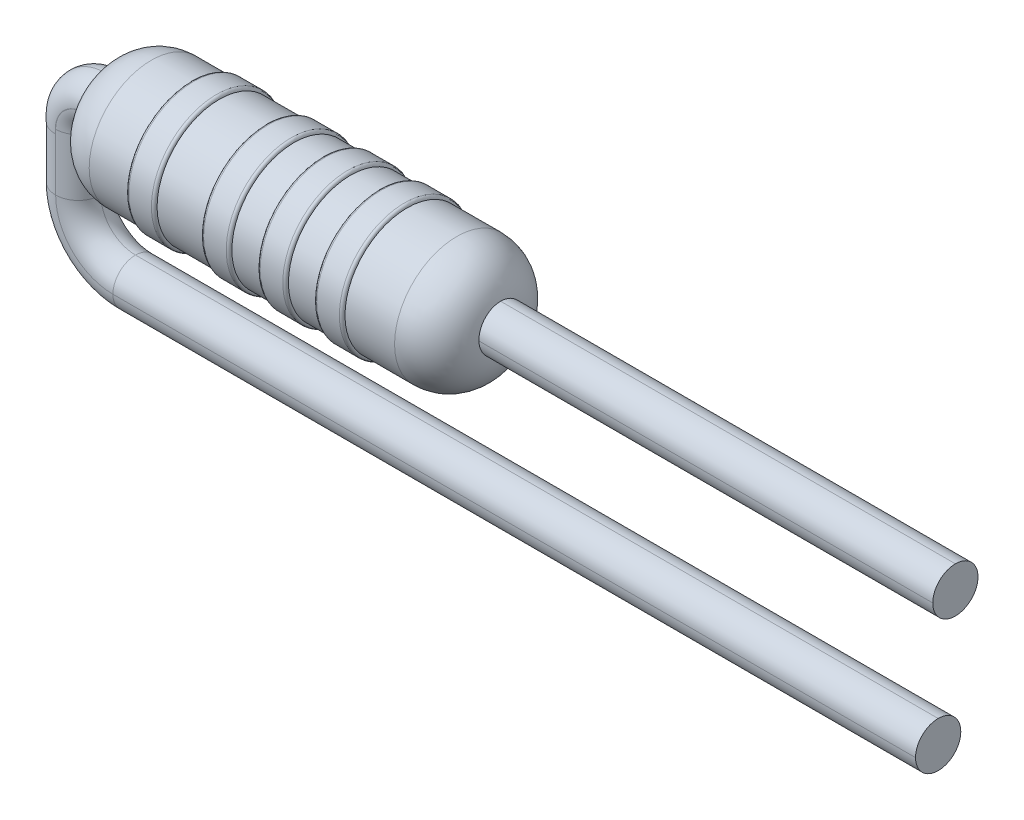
ISO-10303-21;
HEADER;
FILE_DESCRIPTION(('STEP AP214'),'2;1');
FILE_NAME('part.step','',(''),(''),'','','');
FILE_SCHEMA(('AUTOMOTIVE_DESIGN { 1 0 10303 214 1 1 1 1 }'));
ENDSEC;
DATA;
#1=APPLICATION_CONTEXT('core data for automotive mechanical design processes');
#2=APPLICATION_PROTOCOL_DEFINITION('international standard','automotive_design',2000,#1);
#3=PRODUCT_CONTEXT('',#1,'mechanical');
#4=PRODUCT('Part','Part','',(#3));
#5=PRODUCT_RELATED_PRODUCT_CATEGORY('part','',(#4));
#6=PRODUCT_DEFINITION_FORMATION('','',#4);
#7=PRODUCT_DEFINITION_CONTEXT('part definition',#1,'design');
#8=PRODUCT_DEFINITION('design','',#6,#7);
#9=PRODUCT_DEFINITION_SHAPE('','',#8);
#10=(LENGTH_UNIT() NAMED_UNIT(*) SI_UNIT(.MILLI.,.METRE.));
#11=(NAMED_UNIT(*) PLANE_ANGLE_UNIT() SI_UNIT($,.RADIAN.));
#12=(NAMED_UNIT(*) SI_UNIT($,.STERADIAN.) SOLID_ANGLE_UNIT());
#13=UNCERTAINTY_MEASURE_WITH_UNIT(LENGTH_MEASURE(1.E-05),#10,'distance_accuracy_value','');
#14=(GEOMETRIC_REPRESENTATION_CONTEXT(3) GLOBAL_UNCERTAINTY_ASSIGNED_CONTEXT((#13)) GLOBAL_UNIT_ASSIGNED_CONTEXT((#10,
#11,#12)) REPRESENTATION_CONTEXT('',''));
#15=CARTESIAN_POINT('',(0.,0.,0.));
#16=DIRECTION('',(0.,0.,1.));
#17=DIRECTION('',(1.,0.,0.));
#18=AXIS2_PLACEMENT_3D('',#15,#16,#17);
#19=CARTESIAN_POINT('',(-2.7,0.,0.));
#20=DIRECTION('',(-1.,0.,0.));
#21=DIRECTION('',(0.,0.,1.));
#22=AXIS2_PLACEMENT_3D('',#19,#20,#21);
#23=DEGENERATE_TOROIDAL_SURFACE('',#22,0.3,0.8,.T.);
#24=CARTESIAN_POINT('',(-2.69999999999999,0.,0.));
#25=DIRECTION('',(-1.,0.,0.));
#26=DIRECTION('',(0.,0.,1.));
#27=AXIS2_PLACEMENT_3D('',#24,#25,#26);
#28=CIRCLE('',#27,1.1);
#29=CARTESIAN_POINT('',(-2.69999999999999,0.,1.1));
#30=VERTEX_POINT('',#29);
#31=EDGE_CURVE('E482',#30,#30,#28,.T.);
#32=ORIENTED_EDGE('',*,*,#31,.T.);
#33=EDGE_LOOP('',(#32));
#34=FACE_BOUND('',#33,.T.);
#35=CARTESIAN_POINT('',(-3.45180006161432,-0.41096294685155,0.4));
#36=CARTESIAN_POINT('',(-3.44547312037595,-0.435243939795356,0.4));
#37=CARTESIAN_POINT('',(-3.43824276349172,-0.459288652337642,0.4));
#38=CARTESIAN_POINT('',(-3.4218719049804,-0.506726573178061,0.4));
#39=CARTESIAN_POINT('',(-3.41273066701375,-0.530119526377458,0.4));
#40=CARTESIAN_POINT('',(-3.382344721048,-0.598967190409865,0.4));
#41=CARTESIAN_POINT('',(-3.35811950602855,-0.643163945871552,0.4));
#42=CARTESIAN_POINT('',(-3.30191340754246,-0.726358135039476,0.4));
#43=CARTESIAN_POINT('',(-3.26992833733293,-0.765352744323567,0.4));
#44=CARTESIAN_POINT('',(-3.19902042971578,-0.836514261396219,0.4));
#45=CARTESIAN_POINT('',(-3.16009397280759,-0.868677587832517,0.4));
#46=CARTESIAN_POINT('',(-3.08177246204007,-0.921307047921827,0.4));
#47=CARTESIAN_POINT('',(-3.04301006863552,-0.942720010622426,0.4));
#48=CARTESIAN_POINT('',(-2.96235754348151,-0.978425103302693,0.4));
#49=CARTESIAN_POINT('',(-2.92046994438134,-0.992722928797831,0.4));
#50=CARTESIAN_POINT('',(-2.83648242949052,-1.01331755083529,0.4));
#51=CARTESIAN_POINT('',(-2.79445237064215,-1.01990037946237,0.4));
#52=CARTESIAN_POINT('',(-2.70987781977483,-1.02583397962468,0.4));
#53=CARTESIAN_POINT('',(-2.66733328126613,-1.02518409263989,0.4));
#54=CARTESIAN_POINT('',(-2.58342776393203,-1.01671641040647,0.4));
#55=CARTESIAN_POINT('',(-2.54205898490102,-1.0089755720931,0.4));
#56=CARTESIAN_POINT('',(-2.46121135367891,-0.986681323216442,0.4));
#57=CARTESIAN_POINT('',(-2.42173208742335,-0.972129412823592,0.4));
#58=CARTESIAN_POINT('',(-2.34562363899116,-0.93661268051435,0.4));
#59=CARTESIAN_POINT('',(-2.30900384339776,-0.915627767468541,0.4));
#60=CARTESIAN_POINT('',(-2.23970669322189,-0.867904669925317,0.4));
#61=CARTESIAN_POINT('',(-2.20703150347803,-0.841163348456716,0.4));
#62=CARTESIAN_POINT('',(-2.14584269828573,-0.782180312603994,0.4));
#63=CARTESIAN_POINT('',(-2.11742347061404,-0.749840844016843,0.4));
#64=CARTESIAN_POINT('',(-2.06615541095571,-0.681096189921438,0.4));
#65=CARTESIAN_POINT('',(-2.04329966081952,-0.644696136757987,0.4));
#66=CARTESIAN_POINT('',(-2.00233490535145,-0.566895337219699,0.4));
#67=CARTESIAN_POINT('',(-1.9845347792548,-0.525332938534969,0.4));
#68=CARTESIAN_POINT('',(-1.95512070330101,-0.440015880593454,0.4));
#69=CARTESIAN_POINT('',(-1.94352046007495,-0.396256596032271,0.4));
#70=CARTESIAN_POINT('',(-1.92531514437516,-0.305634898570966,0.4));
#71=CARTESIAN_POINT('',(-1.91896935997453,-0.258723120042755,0.4));
#72=CARTESIAN_POINT('',(-1.91037720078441,-0.164470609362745,0.4));
#73=CARTESIAN_POINT('',(-1.90814085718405,-0.117129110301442,0.4));
#74=CARTESIAN_POINT('',(-1.9065158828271,-0.0460050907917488,0.4));
#75=CARTESIAN_POINT('',(-1.90626368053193,-0.0222323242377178,0.4));
#76=CARTESIAN_POINT('',(-1.90628628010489,0.0253129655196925,0.4));
#77=CARTESIAN_POINT('',(-1.9065611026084,0.0490854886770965,0.4));
#78=CARTESIAN_POINT('',(-1.90827037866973,0.120322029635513,0.4));
#79=CARTESIAN_POINT('',(-1.91058769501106,0.167780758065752,0.4));
#80=CARTESIAN_POINT('',(-1.91742829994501,0.241220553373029,0.4));
#81=CARTESIAN_POINT('',(-1.9205045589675,0.267329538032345,0.4));
#82=CARTESIAN_POINT('',(-1.92826814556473,0.319304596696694,0.4));
#83=CARTESIAN_POINT('',(-1.93295538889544,0.34517068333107,0.4));
#84=CARTESIAN_POINT('',(-1.94978313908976,0.421886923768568,0.4));
#85=CARTESIAN_POINT('',(-1.96471264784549,0.472181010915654,0.4));
#86=CARTESIAN_POINT('',(-2.00338467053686,0.570093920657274,0.4));
#87=CARTESIAN_POINT('',(-2.02724142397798,0.61766842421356,0.4));
#88=CARTESIAN_POINT('',(-2.08377850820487,0.707480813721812,0.4));
#89=CARTESIAN_POINT('',(-2.11648009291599,0.749705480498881,0.4));
#90=CARTESIAN_POINT('',(-2.18535139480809,0.822056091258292,0.4));
#91=CARTESIAN_POINT('',(-2.22063816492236,0.853025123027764,0.4));
#92=CARTESIAN_POINT('',(-2.29623680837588,0.907977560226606,0.4));
#93=CARTESIAN_POINT('',(-2.33654179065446,0.9319703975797,0.4));
#94=CARTESIAN_POINT('',(-2.41765706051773,0.970557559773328,0.4));
#95=CARTESIAN_POINT('',(-2.45819360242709,0.98572978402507,0.4));
#96=CARTESIAN_POINT('',(-2.54128009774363,1.00887481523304,0.4));
#97=CARTESIAN_POINT('',(-2.58383005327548,1.01684761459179,0.4));
#98=CARTESIAN_POINT('',(-2.66865854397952,1.02522595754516,0.4));
#99=CARTESIAN_POINT('',(-2.71092012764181,1.02580422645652,0.4));
#100=CARTESIAN_POINT('',(-2.79493458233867,1.01982238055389,0.4));
#101=CARTESIAN_POINT('',(-2.83668747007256,1.01326250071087,0.4));
#102=CARTESIAN_POINT('',(-2.91831419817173,0.993256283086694,0.4));
#103=CARTESIAN_POINT('',(-2.95819541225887,0.979839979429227,0.4));
#104=CARTESIAN_POINT('',(-3.03515588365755,0.946563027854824,0.4));
#105=CARTESIAN_POINT('',(-3.07223585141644,0.926704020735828,0.4));
#106=CARTESIAN_POINT('',(-3.14292662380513,0.88095763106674,0.4));
#107=CARTESIAN_POINT('',(-3.17650425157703,0.855019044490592,0.4));
#108=CARTESIAN_POINT('',(-3.23900389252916,0.797993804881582,0.4));
#109=CARTESIAN_POINT('',(-3.26792144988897,0.76690228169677,0.4));
#110=CARTESIAN_POINT('',(-3.32125130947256,0.699526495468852,0.4));
#111=CARTESIAN_POINT('',(-3.34550002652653,0.663113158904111,0.4));
#112=CARTESIAN_POINT('',(-3.38796234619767,0.587072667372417,0.4));
#113=CARTESIAN_POINT('',(-3.40619233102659,0.547454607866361,0.4));
#114=CARTESIAN_POINT('',(-3.43235005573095,0.477899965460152,0.4));
#115=CARTESIAN_POINT('',(-3.44173217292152,0.448493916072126,0.4));
#116=CARTESIAN_POINT('',(-3.45775906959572,0.388942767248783,0.4));
#117=CARTESIAN_POINT('',(-3.46440322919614,0.358797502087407,0.4));
#118=CARTESIAN_POINT('',(-3.47533837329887,0.29782693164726,0.4));
#119=CARTESIAN_POINT('',(-3.47960842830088,0.26699799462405,0.4));
#120=CARTESIAN_POINT('',(-3.48621542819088,0.205138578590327,0.4));
#121=CARTESIAN_POINT('',(-3.48855196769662,0.174108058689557,0.4));
#122=CARTESIAN_POINT('',(-3.49144231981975,0.119773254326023,0.4));
#123=CARTESIAN_POINT('',(-3.49229626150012,0.096482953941,0.4));
#124=CARTESIAN_POINT('',(-3.4934249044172,0.0498880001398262,0.4));
#125=CARTESIAN_POINT('',(-3.49369958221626,0.026583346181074,0.4));
#126=CARTESIAN_POINT('',(-3.49374784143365,-0.0200482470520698,0.4));
#127=CARTESIAN_POINT('',(-3.49352096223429,-0.0433751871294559,0.4));
#128=CARTESIAN_POINT('',(-3.49249930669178,-0.0900148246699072,0.4));
#129=CARTESIAN_POINT('',(-3.49170454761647,-0.11332752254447,0.4));
#130=CARTESIAN_POINT('',(-3.48821678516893,-0.18286820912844,0.4));
#131=CARTESIAN_POINT('',(-3.48442521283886,-0.229056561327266,0.4));
#132=CARTESIAN_POINT('',(-3.47203565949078,-0.320750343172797,0.4));
#133=CARTESIAN_POINT('',(-3.463449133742,-0.366257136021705,0.4));
#134=CARTESIAN_POINT('',(-3.45180006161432,-0.41096294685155,0.4));
#135=B_SPLINE_CURVE_WITH_KNOTS('',3,(#35,#36,#37,#38,#39,#40,#41,#42,#43,#44,#45,#46,#47,#48,
#49,#50,#51,#52,#53,#54,#55,#56,#57,#58,#59,#60,#61,#62,#63,#64,#65,#66,#67,#68,#69,#70,#71,#72,
#73,#74,#75,#76,#77,#78,#79,#80,#81,#82,#83,#84,#85,#86,#87,#88,#89,#90,#91,#92,#93,#94,#95,#96,
#97,#98,#99,#100,#101,#102,#103,#104,#105,#106,#107,#108,#109,#110,#111,#112,#113,#114,#115,
#116,#117,#118,#119,#120,#121,#122,#123,#124,#125,#126,#127,#128,#129,#130,#131,#132,#133,#134),
.UNSPECIFIED.,.T.,.F.,(4,2,2,2,2,2,2,2,2,2,2,2,2,2,2,2,2,2,2,2,2,2,2,2,2,2,2,2,2,2,2,2,2,2,2,2,
2,2,2,2,2,2,2,2,2,2,2,2,2,4),(0.,0.0752492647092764,0.150527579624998,0.300860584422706,
0.451274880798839,0.601767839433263,0.733959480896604,0.866045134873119,0.993061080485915,
1.1200885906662,1.24575361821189,1.37139098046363,1.49742479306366,1.62352746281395,
1.75210796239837,1.88052774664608,2.0156298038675,2.15102932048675,2.29276791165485,
2.43485203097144,2.50617076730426,2.57749229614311,2.71990817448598,2.79873277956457,
2.8775532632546,3.03422212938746,3.1929685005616,3.35209977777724,3.49219346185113,
3.63209684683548,3.76131409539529,3.89053148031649,4.01672487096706,4.14291410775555,
4.26855525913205,4.39416443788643,4.520872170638,4.64770034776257,4.7783820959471,
4.90870515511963,5.00117303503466,5.09366183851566,5.18695357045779,5.28026485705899,
5.35017504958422,5.42008807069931,5.49006532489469,5.56004045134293,5.69891867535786,
5.83746652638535),.UNSPECIFIED.);
#136=CARTESIAN_POINT('',(-3.49205897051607,0.100529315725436,0.4));
#137=VERTEX_POINT('',#136);
#138=CARTESIAN_POINT('',(-3.4922284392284,0.0954853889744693,0.4));
#139=VERTEX_POINT('',#138);
#140=EDGE_CURVE('E285',#137,#139,#135,.T.);
#141=ORIENTED_EDGE('',*,*,#140,.T.);
#142=CARTESIAN_POINT('',(-3.4922284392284,0.0954853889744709,0.4));
#143=CARTESIAN_POINT('',(-3.4929638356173,0.072978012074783,0.400019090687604));
#144=CARTESIAN_POINT('',(-3.49365729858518,0.0504749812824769,0.398101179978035));
#145=CARTESIAN_POINT('',(-3.49494211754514,0.00611999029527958,0.390532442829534));
#146=CARTESIAN_POINT('',(-3.4955335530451,-0.0157324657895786,0.384884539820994));
#147=CARTESIAN_POINT('',(-3.49659753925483,-0.0581913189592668,0.369992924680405));
#148=CARTESIAN_POINT('',(-3.49707003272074,-0.0787971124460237,0.360747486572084));
#149=CARTESIAN_POINT('',(-3.49789183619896,-0.11816331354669,0.338931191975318));
#150=CARTESIAN_POINT('',(-3.49824116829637,-0.136924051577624,0.326360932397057));
#151=CARTESIAN_POINT('',(-3.49882421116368,-0.172071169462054,0.298249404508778));
#152=CARTESIAN_POINT('',(-3.49905792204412,-0.188457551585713,0.282708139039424));
#153=CARTESIAN_POINT('',(-3.49942838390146,-0.218393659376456,0.249091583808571));
#154=CARTESIAN_POINT('',(-3.49956511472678,-0.231942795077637,0.2310157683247));
#155=CARTESIAN_POINT('',(-3.49976792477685,-0.255817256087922,0.192842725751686));
#156=CARTESIAN_POINT('',(-3.49983398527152,-0.266141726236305,0.172744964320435));
#157=CARTESIAN_POINT('',(-3.49992397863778,-0.283262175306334,0.131104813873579));
#158=CARTESIAN_POINT('',(-3.49994793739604,-0.290060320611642,0.109563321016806));
#159=CARTESIAN_POINT('',(-3.499972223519,-0.298232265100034,0.0732404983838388));
#160=CARTESIAN_POINT('',(-3.49997785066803,-0.300668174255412,0.0586893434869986));
#161=CARTESIAN_POINT('',(-3.4999845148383,-0.303918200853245,0.0294275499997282));
#162=CARTESIAN_POINT('',(-3.4999855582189,-0.30473456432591,0.0147171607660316));
#163=CARTESIAN_POINT('',(-3.49998600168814,-0.304732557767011,0.));
#164=B_SPLINE_CURVE_WITH_KNOTS('',3,(#142,#143,#144,#145,#146,#147,#148,#149,#150,#151,#152,
#153,#154,#155,#156,#157,#158,#159,#160,#161,#162,#163),.UNSPECIFIED.,.F.,.F.,(4,2,2,2,2,2,2,2,
2,2,4),(0.,0.0674684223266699,0.134884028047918,0.202332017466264,0.269767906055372,
0.337203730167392,0.404653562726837,0.472121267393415,0.539547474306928,0.58372450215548,
0.627840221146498),.UNSPECIFIED.);
#165=CARTESIAN_POINT('',(-3.49998600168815,-0.304732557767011,0.));
#166=VERTEX_POINT('',#165);
#167=EDGE_CURVE('E315',#139,#166,#164,.T.);
#168=ORIENTED_EDGE('',*,*,#167,.T.);
#169=CARTESIAN_POINT('',(-3.49998600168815,-0.304732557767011,0.));
#170=CARTESIAN_POINT('',(-3.4999836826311,-0.30475195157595,-0.0224642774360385));
#171=CARTESIAN_POINT('',(-3.49998254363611,-0.302836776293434,-0.0449219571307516));
#172=CARTESIAN_POINT('',(-3.49996489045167,-0.295282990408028,-0.0891835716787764));
#173=CARTESIAN_POINT('',(-3.49994838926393,-0.289647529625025,-0.110988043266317));
#174=CARTESIAN_POINT('',(-3.49988230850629,-0.274793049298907,-0.153358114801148));
#175=CARTESIAN_POINT('',(-3.49983270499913,-0.265571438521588,-0.17392280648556));
#176=CARTESIAN_POINT('',(-3.49967207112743,-0.243816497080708,-0.213213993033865));
#177=CARTESIAN_POINT('',(-3.49956104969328,-0.231283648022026,-0.231940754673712));
#178=CARTESIAN_POINT('',(-3.49924990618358,-0.203231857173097,-0.267065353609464));
#179=CARTESIAN_POINT('',(-3.49904960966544,-0.187707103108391,-0.283458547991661));
#180=CARTESIAN_POINT('',(-3.49853824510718,-0.154125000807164,-0.313410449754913));
#181=CARTESIAN_POINT('',(-3.49822715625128,-0.136067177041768,-0.32696862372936));
#182=CARTESIAN_POINT('',(-3.4974828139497,-0.0979259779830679,-0.350868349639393));
#183=CARTESIAN_POINT('',(-3.49704949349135,-0.0778414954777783,-0.361208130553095));
#184=CARTESIAN_POINT('',(-3.49606131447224,-0.0362282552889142,-0.378363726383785));
#185=CARTESIAN_POINT('',(-3.49550652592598,-0.0147003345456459,-0.38518156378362));
#186=CARTESIAN_POINT('',(-3.49449552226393,0.0217120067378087,-0.393418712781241));
#187=CARTESIAN_POINT('',(-3.49406984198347,0.0363689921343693,-0.395885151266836));
#188=CARTESIAN_POINT('',(-3.49317802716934,0.0658439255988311,-0.399175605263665));
#189=CARTESIAN_POINT('',(-3.49271195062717,0.0806616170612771,-0.400001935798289));
#190=CARTESIAN_POINT('',(-3.4922284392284,0.0954853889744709,-0.4));
#191=B_SPLINE_CURVE_WITH_KNOTS('',3,(#169,#170,#171,#172,#173,#174,#175,#176,#177,#178,#179,
#180,#181,#182,#183,#184,#185,#186,#187,#188,#189,#190),.UNSPECIFIED.,.F.,.F.,(4,2,2,2,2,2,2,2,
2,2,4),(0.,0.0673017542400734,0.134546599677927,0.201840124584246,0.269123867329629,
0.336539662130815,0.403968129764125,0.471433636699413,0.538860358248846,0.583382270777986,
0.627841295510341),.UNSPECIFIED.);
#192=CARTESIAN_POINT('',(-3.4922284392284,0.0954853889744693,-0.4));
#193=VERTEX_POINT('',#192);
#194=EDGE_CURVE('E182',#166,#193,#191,.T.);
#195=ORIENTED_EDGE('',*,*,#194,.T.);
#196=CARTESIAN_POINT('',(-3.45180006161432,-0.41096294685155,-0.4));
#197=CARTESIAN_POINT('',(-3.44547312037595,-0.435243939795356,-0.4));
#198=CARTESIAN_POINT('',(-3.43824276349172,-0.459288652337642,-0.4));
#199=CARTESIAN_POINT('',(-3.4218719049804,-0.506726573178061,-0.4));
#200=CARTESIAN_POINT('',(-3.41273066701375,-0.530119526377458,-0.4));
#201=CARTESIAN_POINT('',(-3.382344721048,-0.598967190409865,-0.4));
#202=CARTESIAN_POINT('',(-3.35811950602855,-0.643163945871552,-0.4));
#203=CARTESIAN_POINT('',(-3.30191340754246,-0.726358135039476,-0.4));
#204=CARTESIAN_POINT('',(-3.26992833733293,-0.765352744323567,-0.4));
#205=CARTESIAN_POINT('',(-3.19902042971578,-0.836514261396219,-0.4));
#206=CARTESIAN_POINT('',(-3.16009397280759,-0.868677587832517,-0.4));
#207=CARTESIAN_POINT('',(-3.08177246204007,-0.921307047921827,-0.4));
#208=CARTESIAN_POINT('',(-3.04301006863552,-0.942720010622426,-0.4));
#209=CARTESIAN_POINT('',(-2.96235754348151,-0.978425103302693,-0.4));
#210=CARTESIAN_POINT('',(-2.92046994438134,-0.992722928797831,-0.4));
#211=CARTESIAN_POINT('',(-2.83648242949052,-1.01331755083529,-0.4));
#212=CARTESIAN_POINT('',(-2.79445237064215,-1.01990037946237,-0.4));
#213=CARTESIAN_POINT('',(-2.70987781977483,-1.02583397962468,-0.4));
#214=CARTESIAN_POINT('',(-2.66733328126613,-1.02518409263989,-0.4));
#215=CARTESIAN_POINT('',(-2.58342776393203,-1.01671641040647,-0.4));
#216=CARTESIAN_POINT('',(-2.54205898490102,-1.0089755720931,-0.4));
#217=CARTESIAN_POINT('',(-2.46121135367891,-0.986681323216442,-0.4));
#218=CARTESIAN_POINT('',(-2.42173208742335,-0.972129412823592,-0.4));
#219=CARTESIAN_POINT('',(-2.34562363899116,-0.93661268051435,-0.4));
#220=CARTESIAN_POINT('',(-2.30900384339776,-0.915627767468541,-0.4));
#221=CARTESIAN_POINT('',(-2.23970669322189,-0.867904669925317,-0.4));
#222=CARTESIAN_POINT('',(-2.20703150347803,-0.841163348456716,-0.4));
#223=CARTESIAN_POINT('',(-2.14584269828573,-0.782180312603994,-0.4));
#224=CARTESIAN_POINT('',(-2.11742347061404,-0.749840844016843,-0.4));
#225=CARTESIAN_POINT('',(-2.06615541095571,-0.681096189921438,-0.4));
#226=CARTESIAN_POINT('',(-2.04329966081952,-0.644696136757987,-0.4));
#227=CARTESIAN_POINT('',(-2.00233490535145,-0.566895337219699,-0.4));
#228=CARTESIAN_POINT('',(-1.9845347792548,-0.525332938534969,-0.4));
#229=CARTESIAN_POINT('',(-1.95512070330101,-0.440015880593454,-0.4));
#230=CARTESIAN_POINT('',(-1.94352046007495,-0.396256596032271,-0.4));
#231=CARTESIAN_POINT('',(-1.92531514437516,-0.305634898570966,-0.4));
#232=CARTESIAN_POINT('',(-1.91896935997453,-0.258723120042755,-0.4));
#233=CARTESIAN_POINT('',(-1.91037720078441,-0.164470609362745,-0.4));
#234=CARTESIAN_POINT('',(-1.90814085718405,-0.117129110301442,-0.4));
#235=CARTESIAN_POINT('',(-1.9065158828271,-0.0460050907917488,-0.4));
#236=CARTESIAN_POINT('',(-1.90626368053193,-0.0222323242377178,-0.4));
#237=CARTESIAN_POINT('',(-1.90628628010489,0.0253129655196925,-0.4));
#238=CARTESIAN_POINT('',(-1.9065611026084,0.0490854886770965,-0.4));
#239=CARTESIAN_POINT('',(-1.90827037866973,0.120322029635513,-0.4));
#240=CARTESIAN_POINT('',(-1.91058769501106,0.167780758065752,-0.4));
#241=CARTESIAN_POINT('',(-1.91742829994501,0.241220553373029,-0.4));
#242=CARTESIAN_POINT('',(-1.9205045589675,0.267329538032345,-0.4));
#243=CARTESIAN_POINT('',(-1.92826814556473,0.319304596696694,-0.4));
#244=CARTESIAN_POINT('',(-1.93295538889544,0.34517068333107,-0.4));
#245=CARTESIAN_POINT('',(-1.94978313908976,0.421886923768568,-0.4));
#246=CARTESIAN_POINT('',(-1.96471264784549,0.472181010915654,-0.4));
#247=CARTESIAN_POINT('',(-2.00338467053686,0.570093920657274,-0.4));
#248=CARTESIAN_POINT('',(-2.02724142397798,0.61766842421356,-0.4));
#249=CARTESIAN_POINT('',(-2.08377850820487,0.707480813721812,-0.4));
#250=CARTESIAN_POINT('',(-2.11648009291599,0.749705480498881,-0.4));
#251=CARTESIAN_POINT('',(-2.18535139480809,0.822056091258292,-0.4));
#252=CARTESIAN_POINT('',(-2.22063816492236,0.853025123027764,-0.4));
#253=CARTESIAN_POINT('',(-2.29623680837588,0.907977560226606,-0.4));
#254=CARTESIAN_POINT('',(-2.33654179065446,0.9319703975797,-0.4));
#255=CARTESIAN_POINT('',(-2.41765706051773,0.970557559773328,-0.4));
#256=CARTESIAN_POINT('',(-2.45819360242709,0.98572978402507,-0.4));
#257=CARTESIAN_POINT('',(-2.54128009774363,1.00887481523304,-0.4));
#258=CARTESIAN_POINT('',(-2.58383005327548,1.01684761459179,-0.4));
#259=CARTESIAN_POINT('',(-2.66865854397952,1.02522595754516,-0.4));
#260=CARTESIAN_POINT('',(-2.71092012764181,1.02580422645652,-0.4));
#261=CARTESIAN_POINT('',(-2.79493458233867,1.01982238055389,-0.4));
#262=CARTESIAN_POINT('',(-2.83668747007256,1.01326250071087,-0.4));
#263=CARTESIAN_POINT('',(-2.91831419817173,0.993256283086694,-0.4));
#264=CARTESIAN_POINT('',(-2.95819541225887,0.979839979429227,-0.4));
#265=CARTESIAN_POINT('',(-3.03515588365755,0.946563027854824,-0.4));
#266=CARTESIAN_POINT('',(-3.07223585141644,0.926704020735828,-0.4));
#267=CARTESIAN_POINT('',(-3.14292662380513,0.88095763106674,-0.4));
#268=CARTESIAN_POINT('',(-3.17650425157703,0.855019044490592,-0.4));
#269=CARTESIAN_POINT('',(-3.23900389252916,0.797993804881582,-0.4));
#270=CARTESIAN_POINT('',(-3.26792144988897,0.76690228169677,-0.4));
#271=CARTESIAN_POINT('',(-3.32125130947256,0.699526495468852,-0.4));
#272=CARTESIAN_POINT('',(-3.34550002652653,0.663113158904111,-0.4));
#273=CARTESIAN_POINT('',(-3.38796234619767,0.587072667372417,-0.4));
#274=CARTESIAN_POINT('',(-3.40619233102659,0.547454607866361,-0.4));
#275=CARTESIAN_POINT('',(-3.43235005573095,0.477899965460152,-0.4));
#276=CARTESIAN_POINT('',(-3.44173217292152,0.448493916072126,-0.4));
#277=CARTESIAN_POINT('',(-3.45775906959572,0.388942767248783,-0.4));
#278=CARTESIAN_POINT('',(-3.46440322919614,0.358797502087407,-0.4));
#279=CARTESIAN_POINT('',(-3.47533837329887,0.29782693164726,-0.4));
#280=CARTESIAN_POINT('',(-3.47960842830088,0.26699799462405,-0.4));
#281=CARTESIAN_POINT('',(-3.48621542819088,0.205138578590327,-0.4));
#282=CARTESIAN_POINT('',(-3.48855196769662,0.174108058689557,-0.4));
#283=CARTESIAN_POINT('',(-3.49144231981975,0.119773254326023,-0.4));
#284=CARTESIAN_POINT('',(-3.49229626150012,0.096482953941,-0.4));
#285=CARTESIAN_POINT('',(-3.4934249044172,0.0498880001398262,-0.4));
#286=CARTESIAN_POINT('',(-3.49369958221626,0.026583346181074,-0.4));
#287=CARTESIAN_POINT('',(-3.49374784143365,-0.0200482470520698,-0.4));
#288=CARTESIAN_POINT('',(-3.49352096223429,-0.0433751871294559,-0.4));
#289=CARTESIAN_POINT('',(-3.49249930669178,-0.0900148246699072,-0.4));
#290=CARTESIAN_POINT('',(-3.49170454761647,-0.11332752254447,-0.4));
#291=CARTESIAN_POINT('',(-3.48821678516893,-0.18286820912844,-0.4));
#292=CARTESIAN_POINT('',(-3.48442521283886,-0.229056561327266,-0.4));
#293=CARTESIAN_POINT('',(-3.47203565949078,-0.320750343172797,-0.4));
#294=CARTESIAN_POINT('',(-3.463449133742,-0.366257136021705,-0.4));
#295=CARTESIAN_POINT('',(-3.45180006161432,-0.41096294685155,-0.4));
#296=B_SPLINE_CURVE_WITH_KNOTS('',3,(#196,#197,#198,#199,#200,#201,#202,#203,#204,#205,#206,
#207,#208,#209,#210,#211,#212,#213,#214,#215,#216,#217,#218,#219,#220,#221,#222,#223,#224,#225,
#226,#227,#228,#229,#230,#231,#232,#233,#234,#235,#236,#237,#238,#239,#240,#241,#242,#243,#244,
#245,#246,#247,#248,#249,#250,#251,#252,#253,#254,#255,#256,#257,#258,#259,#260,#261,#262,#263,
#264,#265,#266,#267,#268,#269,#270,#271,#272,#273,#274,#275,#276,#277,#278,#279,#280,#281,#282,
#283,#284,#285,#286,#287,#288,#289,#290,#291,#292,#293,#294,#295),.UNSPECIFIED.,.T.,.F.,(4,2,2,
2,2,2,2,2,2,2,2,2,2,2,2,2,2,2,2,2,2,2,2,2,2,2,2,2,2,2,2,2,2,2,2,2,2,2,2,2,2,2,2,2,2,2,2,2,2,4),
(0.,0.0752492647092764,0.150527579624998,0.300860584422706,0.451274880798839,0.601767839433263,
0.733959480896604,0.866045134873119,0.993061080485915,1.1200885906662,1.24575361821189,
1.37139098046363,1.49742479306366,1.62352746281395,1.75210796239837,1.88052774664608,
2.0156298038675,2.15102932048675,2.29276791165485,2.43485203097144,2.50617076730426,
2.57749229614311,2.71990817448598,2.79873277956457,2.8775532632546,3.03422212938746,
3.1929685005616,3.35209977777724,3.49219346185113,3.63209684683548,3.76131409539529,
3.89053148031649,4.01672487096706,4.14291410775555,4.26855525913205,4.39416443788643,
4.520872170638,4.64770034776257,4.7783820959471,4.90870515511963,5.00117303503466,
5.09366183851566,5.18695357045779,5.28026485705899,5.35017504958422,5.42008807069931,
5.49006532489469,5.56004045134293,5.69891867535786,5.83746652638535),.UNSPECIFIED.);
#297=CARTESIAN_POINT('',(-3.49205897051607,0.100529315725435,-0.4));
#298=VERTEX_POINT('',#297);
#299=EDGE_CURVE('E286',#298,#193,#296,.T.);
#300=ORIENTED_EDGE('',*,*,#299,.F.);
#301=CARTESIAN_POINT('',(-3.49205897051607,0.100529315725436,-0.4));
#302=CARTESIAN_POINT('',(-3.49128125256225,0.123035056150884,-0.400019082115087));
#303=CARTESIAN_POINT('',(-3.49045918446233,0.145533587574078,-0.398101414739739));
#304=CARTESIAN_POINT('',(-3.48876609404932,0.189876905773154,-0.390532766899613));
#305=CARTESIAN_POINT('',(-3.48789510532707,0.211722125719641,-0.384884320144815));
#306=CARTESIAN_POINT('',(-3.48614233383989,0.254162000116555,-0.369990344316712));
#307=CARTESIAN_POINT('',(-3.48526054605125,0.274756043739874,-0.360743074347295));
#308=CARTESIAN_POINT('',(-3.48352940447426,0.314092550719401,-0.338922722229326));
#309=CARTESIAN_POINT('',(-3.48268004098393,0.332835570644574,-0.326350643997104));
#310=CARTESIAN_POINT('',(-3.48105526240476,0.367938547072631,-0.298239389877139));
#311=CARTESIAN_POINT('',(-3.48027982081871,0.384299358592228,-0.28270128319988));
#312=CARTESIAN_POINT('',(-3.47884052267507,0.414190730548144,-0.249084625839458));
#313=CARTESIAN_POINT('',(-3.4781767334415,0.427719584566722,-0.231004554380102));
#314=CARTESIAN_POINT('',(-3.47699421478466,0.451553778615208,-0.192822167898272));
#315=CARTESIAN_POINT('',(-3.47647553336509,0.461858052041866,-0.172719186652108));
#316=CARTESIAN_POINT('',(-3.47561048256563,0.478926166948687,-0.131095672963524));
#317=CARTESIAN_POINT('',(-3.47526376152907,0.485697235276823,-0.109578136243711));
#318=CARTESIAN_POINT('',(-3.47491324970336,0.492518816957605,-0.0792012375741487));
#319=CARTESIAN_POINT('',(-3.47482958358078,0.494143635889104,-0.0706770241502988));
#320=CARTESIAN_POINT('',(-3.47476042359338,0.495486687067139,-0.0621132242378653));
#321=B_SPLINE_CURVE_WITH_KNOTS('',3,(#301,#302,#303,#304,#305,#306,#307,#308,#309,#310,#311,
#312,#313,#314,#315,#316,#317,#318,#319,#320),.UNSPECIFIED.,.F.,.F.,(4,2,2,2,2,2,2,2,2,4),(0.,
0.0674678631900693,0.134889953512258,0.202344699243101,0.269779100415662,0.33718923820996,
0.404639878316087,0.472112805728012,0.539447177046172,0.565461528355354),.UNSPECIFIED.);
#322=CARTESIAN_POINT('',(-3.47476042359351,0.495486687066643,-0.0621132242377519));
#323=VERTEX_POINT('',#322);
#324=EDGE_CURVE('E321',#298,#323,#321,.T.);
#325=ORIENTED_EDGE('',*,*,#324,.T.);
#326=CARTESIAN_POINT('',(-3.47574799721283,0.495486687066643,0.));
#327=CARTESIAN_POINT('',(-3.47575238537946,0.495486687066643,-0.043004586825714));
#328=CARTESIAN_POINT('',(-3.47437754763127,0.495486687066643,-0.0860135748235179));
#329=CARTESIAN_POINT('',(-3.46842783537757,0.495486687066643,-0.171840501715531));
#330=CARTESIAN_POINT('',(-3.46385205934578,0.495486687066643,-0.214658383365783));
#331=CARTESIAN_POINT('',(-3.45054797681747,0.495486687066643,-0.299302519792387));
#332=CARTESIAN_POINT('',(-3.44185592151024,0.495486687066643,-0.34113414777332));
#333=CARTESIAN_POINT('',(-3.41944518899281,0.495486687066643,-0.423395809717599));
#334=CARTESIAN_POINT('',(-3.40573450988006,0.495486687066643,-0.463827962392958));
#335=CARTESIAN_POINT('',(-3.37210182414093,0.495486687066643,-0.543933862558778));
#336=CARTESIAN_POINT('',(-3.35195784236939,0.495486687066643,-0.583516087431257));
#337=CARTESIAN_POINT('',(-3.30553477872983,0.495486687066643,-0.658998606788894));
#338=CARTESIAN_POINT('',(-3.27924883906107,0.495486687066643,-0.694894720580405));
#339=CARTESIAN_POINT('',(-3.22081952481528,0.495486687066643,-0.761819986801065));
#340=CARTESIAN_POINT('',(-3.18865469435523,0.495486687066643,-0.792830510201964));
#341=CARTESIAN_POINT('',(-3.11932446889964,0.495486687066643,-0.848644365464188));
#342=CARTESIAN_POINT('',(-3.08216067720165,0.495486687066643,-0.873449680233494));
#343=CARTESIAN_POINT('',(-3.00590469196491,0.495486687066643,-0.914828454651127));
#344=CARTESIAN_POINT('',(-2.9670023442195,0.495486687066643,-0.931752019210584));
#345=CARTESIAN_POINT('',(-2.88683506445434,0.495486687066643,-0.958524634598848));
#346=CARTESIAN_POINT('',(-2.8455706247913,0.495486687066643,-0.968375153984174));
#347=CARTESIAN_POINT('',(-2.7636034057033,0.495486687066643,-0.980404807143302));
#348=CARTESIAN_POINT('',(-2.72294245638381,0.495486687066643,-0.982870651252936));
#349=CARTESIAN_POINT('',(-2.6417930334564,0.495486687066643,-0.980866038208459));
#350=CARTESIAN_POINT('',(-2.60130454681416,0.495486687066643,-0.976396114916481));
#351=CARTESIAN_POINT('',(-2.52206423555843,0.495486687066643,-0.960749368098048));
#352=CARTESIAN_POINT('',(-2.4832992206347,0.495486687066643,-0.94963913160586));
#353=CARTESIAN_POINT('',(-2.40816293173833,0.495486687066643,-0.92113629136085));
#354=CARTESIAN_POINT('',(-2.3717913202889,0.495486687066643,-0.903744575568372));
#355=CARTESIAN_POINT('',(-2.30202179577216,0.495486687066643,-0.863025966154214));
#356=CARTESIAN_POINT('',(-2.26865970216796,0.495486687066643,-0.839637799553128));
#357=CARTESIAN_POINT('',(-2.20614888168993,0.495486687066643,-0.787768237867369));
#358=CARTESIAN_POINT('',(-2.17700246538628,0.495486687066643,-0.759284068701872));
#359=CARTESIAN_POINT('',(-2.12250285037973,0.495486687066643,-0.696943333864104));
#360=CARTESIAN_POINT('',(-2.09733760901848,0.495486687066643,-0.662922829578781));
#361=CARTESIAN_POINT('',(-2.05256695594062,0.495486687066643,-0.591504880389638));
#362=CARTESIAN_POINT('',(-2.03295410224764,0.495486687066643,-0.554112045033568));
#363=CARTESIAN_POINT('',(-1.99239688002,0.495486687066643,-0.461369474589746));
#364=CARTESIAN_POINT('',(-1.97410098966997,0.495486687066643,-0.404855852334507));
#365=CARTESIAN_POINT('',(-1.95360997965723,0.495486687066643,-0.318421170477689));
#366=CARTESIAN_POINT('',(-1.9479310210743,0.495486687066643,-0.289228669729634));
#367=CARTESIAN_POINT('',(-1.93858360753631,0.495486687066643,-0.230516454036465));
#368=CARTESIAN_POINT('',(-1.93491528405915,0.495486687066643,-0.200996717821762));
#369=CARTESIAN_POINT('',(-1.9280967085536,0.495486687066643,-0.12966763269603));
#370=CARTESIAN_POINT('',(-1.92577563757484,0.495486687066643,-0.0877822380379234));
#371=CARTESIAN_POINT('',(-1.92380162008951,0.495486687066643,-0.00392729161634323));
#372=CARTESIAN_POINT('',(-1.92415068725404,0.495486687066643,0.0380422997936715));
#373=CARTESIAN_POINT('',(-1.9276340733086,0.495486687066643,0.121721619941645));
#374=CARTESIAN_POINT('',(-1.93075791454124,0.495486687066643,0.163431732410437));
#375=CARTESIAN_POINT('',(-1.94056548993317,0.495486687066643,0.246424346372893));
#376=CARTESIAN_POINT('',(-1.94724670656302,0.495486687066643,0.287707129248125));
#377=CARTESIAN_POINT('',(-1.96670259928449,0.495486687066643,0.376596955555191));
#378=CARTESIAN_POINT('',(-1.98034906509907,0.495486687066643,0.424024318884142));
#379=CARTESIAN_POINT('',(-2.01491737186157,0.495486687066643,0.516119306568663));
#380=CARTESIAN_POINT('',(-2.03582638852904,0.495486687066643,0.560791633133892));
#381=CARTESIAN_POINT('',(-2.08542002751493,0.495486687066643,0.646168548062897));
#382=CARTESIAN_POINT('',(-2.11417076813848,0.495486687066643,0.686835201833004));
#383=CARTESIAN_POINT('',(-2.17893382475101,0.495486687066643,0.762008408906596));
#384=CARTESIAN_POINT('',(-2.21495076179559,0.495486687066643,0.796511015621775));
#385=CARTESIAN_POINT('',(-2.28880168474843,0.495486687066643,0.85432448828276));
#386=CARTESIAN_POINT('',(-2.32600062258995,0.495486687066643,0.878448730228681));
#387=CARTESIAN_POINT('',(-2.40413004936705,0.495486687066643,0.919570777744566));
#388=CARTESIAN_POINT('',(-2.44505754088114,0.495486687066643,0.936574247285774));
#389=CARTESIAN_POINT('',(-2.52647446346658,0.495486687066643,0.961918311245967));
#390=CARTESIAN_POINT('',(-2.56680664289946,0.495486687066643,0.970766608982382));
#391=CARTESIAN_POINT('',(-2.64839360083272,0.495486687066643,0.981404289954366));
#392=CARTESIAN_POINT('',(-2.6896482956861,0.495486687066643,0.983194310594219));
#393=CARTESIAN_POINT('',(-2.77096474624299,0.495486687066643,0.979691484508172));
#394=CARTESIAN_POINT('',(-2.81103311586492,0.495486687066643,0.974549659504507));
#395=CARTESIAN_POINT('',(-2.88973578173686,0.495486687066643,0.957620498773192));
#396=CARTESIAN_POINT('',(-2.92837019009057,0.495486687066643,0.945833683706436));
#397=CARTESIAN_POINT('',(-3.00319859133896,0.495486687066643,0.915979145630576));
#398=CARTESIAN_POINT('',(-3.03938853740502,0.495486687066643,0.89790129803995));
#399=CARTESIAN_POINT('',(-3.10831007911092,0.495486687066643,0.856058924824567));
#400=CARTESIAN_POINT('',(-3.14104142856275,0.495486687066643,0.832293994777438));
#401=CARTESIAN_POINT('',(-3.20300014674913,0.495486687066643,0.779207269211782));
#402=CARTESIAN_POINT('',(-3.2321253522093,0.495486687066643,0.749766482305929));
#403=CARTESIAN_POINT('',(-3.28535187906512,0.495486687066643,0.686663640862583));
#404=CARTESIAN_POINT('',(-3.30945246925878,0.495486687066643,0.653000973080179));
#405=CARTESIAN_POINT('',(-3.35370197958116,0.495486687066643,0.580244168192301));
#406=CARTESIAN_POINT('',(-3.37350583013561,0.495486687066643,0.540941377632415));
#407=CARTESIAN_POINT('',(-3.40720837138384,0.495486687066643,0.459941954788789));
#408=CARTESIAN_POINT('',(-3.42111015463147,0.495486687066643,0.418246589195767));
#409=CARTESIAN_POINT('',(-3.44046171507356,0.495486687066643,0.345422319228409));
#410=CARTESIAN_POINT('',(-3.44718886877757,0.495486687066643,0.314617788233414));
#411=CARTESIAN_POINT('',(-3.45828065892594,0.495486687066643,0.252576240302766));
#412=CARTESIAN_POINT('',(-3.46264410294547,0.495486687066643,0.221339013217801));
#413=CARTESIAN_POINT('',(-3.4694262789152,0.495486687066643,0.158455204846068));
#414=CARTESIAN_POINT('',(-3.47183199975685,0.495486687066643,0.126807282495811));
#415=CARTESIAN_POINT('',(-3.474991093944,0.495486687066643,0.0634403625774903));
#416=CARTESIAN_POINT('',(-3.47574476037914,0.495486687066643,0.0317213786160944));
#417=CARTESIAN_POINT('',(-3.47574799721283,0.495486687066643,0.));
#418=B_SPLINE_CURVE_WITH_KNOTS('',3,(#326,#327,#328,#329,#330,#331,#332,#333,#334,#335,#336,
#337,#338,#339,#340,#341,#342,#343,#344,#345,#346,#347,#348,#349,#350,#351,#352,#353,#354,#355,
#356,#357,#358,#359,#360,#361,#362,#363,#364,#365,#366,#367,#368,#369,#370,#371,#372,#373,#374,
#375,#376,#377,#378,#379,#380,#381,#382,#383,#384,#385,#386,#387,#388,#389,#390,#391,#392,#393,
#394,#395,#396,#397,#398,#399,#400,#401,#402,#403,#404,#405,#406,#407,#408,#409,#410,#411,#412,
#413,#414,#415,#416,#417),.UNSPECIFIED.,.T.,.F.,(4,2,2,2,2,2,2,2,2,2,2,2,2,2,2,2,2,2,2,2,2,2,2,
2,2,2,2,2,2,2,2,2,2,2,2,2,2,2,2,2,2,2,2,2,2,4),(0.,0.128994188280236,0.258024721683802,
0.385939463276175,0.51365123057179,0.646358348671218,0.779214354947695,0.912565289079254,
1.04587355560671,1.17250422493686,1.29910859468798,1.42072935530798,1.54234075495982,
1.66275266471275,1.78314755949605,1.9048254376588,2.02656975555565,2.15297531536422,
2.27921064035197,2.45631683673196,2.54548701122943,2.63466301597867,2.76040438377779,
2.88624058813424,3.01160364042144,3.13687809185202,3.28441235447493,3.43168741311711,
3.58024482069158,3.72889700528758,3.86120710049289,3.99341175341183,4.11668363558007,
4.23994438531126,4.3605626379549,4.48117144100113,4.60197525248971,4.7227876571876,
4.84648084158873,4.97019201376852,5.10170511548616,5.23314922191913,5.32764485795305,
5.4221881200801,5.51735470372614,5.61250440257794),.UNSPECIFIED.);
#419=CARTESIAN_POINT('',(-3.47476042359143,0.495486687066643,0.0621132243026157));
#420=VERTEX_POINT('',#419);
#421=EDGE_CURVE('E278',#420,#323,#418,.T.);
#422=ORIENTED_EDGE('',*,*,#421,.F.);
#423=CARTESIAN_POINT('',(-3.47476042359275,0.495486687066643,0.0621132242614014));
#424=CARTESIAN_POINT('',(-3.47493112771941,0.492163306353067,0.0833734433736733));
#425=CARTESIAN_POINT('',(-3.47519218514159,0.487097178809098,0.104353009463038));
#426=CARTESIAN_POINT('',(-3.47587714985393,0.47367876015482,0.145223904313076));
#427=CARTESIAN_POINT('',(-3.47630100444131,0.465327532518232,0.165115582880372));
#428=CARTESIAN_POINT('',(-3.47731634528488,0.445087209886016,0.204163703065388));
#429=CARTESIAN_POINT('',(-3.47791455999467,0.433054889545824,0.223245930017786));
#430=CARTESIAN_POINT('',(-3.47923909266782,0.40596519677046,0.259113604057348));
#431=CARTESIAN_POINT('',(-3.47996538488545,0.390908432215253,0.275899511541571));
#432=CARTESIAN_POINT('',(-3.48151038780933,0.3581906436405,0.306707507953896));
#433=CARTESIAN_POINT('',(-3.48232911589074,0.340529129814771,0.320729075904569));
#434=CARTESIAN_POINT('',(-3.48401903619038,0.303094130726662,0.34561385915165));
#435=CARTESIAN_POINT('',(-3.48489025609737,0.283319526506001,0.356475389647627));
#436=CARTESIAN_POINT('',(-3.48664345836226,0.242207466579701,0.374733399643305));
#437=CARTESIAN_POINT('',(-3.48752545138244,0.22086833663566,0.38212610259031));
#438=CARTESIAN_POINT('',(-3.48925630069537,0.177280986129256,0.393206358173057));
#439=CARTESIAN_POINT('',(-3.49010521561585,0.155034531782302,0.396900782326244));
#440=CARTESIAN_POINT('',(-3.49130773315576,0.121963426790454,0.399570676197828));
#441=CARTESIAN_POINT('',(-3.4916884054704,0.111243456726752,0.400003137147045));
#442=CARTESIAN_POINT('',(-3.49205897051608,0.100529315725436,0.400000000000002));
#443=B_SPLINE_CURVE_WITH_KNOTS('',3,(#423,#424,#425,#426,#427,#428,#429,#430,#431,#432,#433,
#434,#435,#436,#437,#438,#439,#440,#441,#442),.UNSPECIFIED.,.F.,.F.,(4,2,2,2,2,2,2,2,2,4),(0.,
0.0644763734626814,0.128931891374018,0.196309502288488,0.263673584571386,0.33105035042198,
0.398462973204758,0.465948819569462,0.533309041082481,0.565478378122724),.UNSPECIFIED.);
#444=EDGE_CURVE('E358',#420,#137,#443,.T.);
#445=ORIENTED_EDGE('',*,*,#444,.T.);
#446=EDGE_LOOP('',(#141,#168,#195,#300,#325,#422,#445));
#447=FACE_BOUND('',#446,.T.);
#448=ADVANCED_FACE('F27',(#34,#447),#23,.T.);
#449=CARTESIAN_POINT('',(-54.2686615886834,0.,0.));
#450=DIRECTION('',(-1.,0.,0.));
#451=DIRECTION('',(0.,0.,1.));
#452=AXIS2_PLACEMENT_3D('',#449,#450,#451);
#453=CYLINDRICAL_SURFACE('',#452,1.1);
#454=CARTESIAN_POINT('',(0.322975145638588,0.,0.));
#455=DIRECTION('',(-1.,0.,0.));
#456=DIRECTION('',(0.,0.,1.));
#457=AXIS2_PLACEMENT_3D('',#454,#455,#456);
#458=CIRCLE('',#457,1.1);
#459=CARTESIAN_POINT('',(0.322975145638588,0.,1.1));
#460=VERTEX_POINT('',#459);
#461=EDGE_CURVE('E496',#460,#460,#458,.T.);
#462=ORIENTED_EDGE('',*,*,#461,.T.);
#463=EDGE_LOOP('',(#462));
#464=FACE_BOUND('',#463,.T.);
#465=CARTESIAN_POINT('',(-0.177024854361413,0.,0.));
#466=DIRECTION('',(1.,0.,0.));
#467=DIRECTION('',(0.,0.,-1.));
#468=AXIS2_PLACEMENT_3D('',#465,#466,#467);
#469=CIRCLE('',#468,1.1);
#470=CARTESIAN_POINT('',(-0.177024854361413,0.,-1.1));
#471=VERTEX_POINT('',#470);
#472=EDGE_CURVE('E486',#471,#471,#469,.T.);
#473=ORIENTED_EDGE('',*,*,#472,.T.);
#474=EDGE_LOOP('',(#473));
#475=FACE_BOUND('',#474,.T.);
#476=ADVANCED_FACE('F297',(#464,#475),#453,.T.);
#477=CARTESIAN_POINT('',(4.3261723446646,0.,0.));
#478=DIRECTION('',(1.,0.,0.));
#479=DIRECTION('',(0.,0.,-1.));
#480=AXIS2_PLACEMENT_3D('',#477,#478,#479);
#481=CYLINDRICAL_SURFACE('',#480,1.15);
#482=CARTESIAN_POINT('',(-0.627024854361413,0.,0.));
#483=DIRECTION('',(-1.,0.,0.));
#484=DIRECTION('',(0.,0.,1.));
#485=AXIS2_PLACEMENT_3D('',#482,#483,#484);
#486=CIRCLE('',#485,1.15);
#487=CARTESIAN_POINT('',(-0.627024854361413,0.,1.15));
#488=VERTEX_POINT('',#487);
#489=EDGE_CURVE('E520',#488,#488,#486,.F.);
#490=ORIENTED_EDGE('',*,*,#489,.T.);
#491=EDGE_LOOP('',(#490));
#492=FACE_BOUND('',#491,.T.);
#493=CARTESIAN_POINT('',(-0.227024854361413,0.,0.));
#494=DIRECTION('',(1.,0.,0.));
#495=DIRECTION('',(0.,0.,-1.));
#496=AXIS2_PLACEMENT_3D('',#493,#494,#495);
#497=CIRCLE('',#496,1.15);
#498=CARTESIAN_POINT('',(-0.227024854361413,0.,-1.15));
#499=VERTEX_POINT('',#498);
#500=EDGE_CURVE('E517',#499,#499,#497,.F.);
#501=ORIENTED_EDGE('',*,*,#500,.T.);
#502=EDGE_LOOP('',(#501));
#503=FACE_BOUND('',#502,.T.);
#504=ADVANCED_FACE('F299',(#492,#503),#481,.T.);
#505=CARTESIAN_POINT('',(-1.5,0.,0.));
#506=DIRECTION('',(1.,0.,0.));
#507=DIRECTION('',(0.,0.,-1.));
#508=AXIS2_PLACEMENT_3D('',#505,#506,#507);
#509=CIRCLE('',#508,1.1);
#510=CARTESIAN_POINT('',(-1.5,0.,-1.1));
#511=VERTEX_POINT('',#510);
#512=EDGE_CURVE('E481',#511,#511,#509,.T.);
#513=ORIENTED_EDGE('',*,*,#512,.T.);
#514=EDGE_LOOP('',(#513));
#515=FACE_BOUND('',#514,.T.);
#516=CARTESIAN_POINT('',(-0.677024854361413,0.,0.));
#517=DIRECTION('',(-1.,0.,0.));
#518=DIRECTION('',(0.,0.,1.));
#519=AXIS2_PLACEMENT_3D('',#516,#517,#518);
#520=CIRCLE('',#519,1.1);
#521=CARTESIAN_POINT('',(-0.677024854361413,0.,1.1));
#522=VERTEX_POINT('',#521);
#523=EDGE_CURVE('E490',#522,#522,#520,.T.);
#524=ORIENTED_EDGE('',*,*,#523,.T.);
#525=EDGE_LOOP('',(#524));
#526=FACE_BOUND('',#525,.T.);
#527=ADVANCED_FACE('F301',(#515,#526),#453,.T.);
#528=CARTESIAN_POINT('',(4.3261723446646,0.,0.));
#529=DIRECTION('',(1.,0.,0.));
#530=DIRECTION('',(0.,0.,-1.));
#531=AXIS2_PLACEMENT_3D('',#528,#529,#530);
#532=CYLINDRICAL_SURFACE('',#531,1.15);
#533=CARTESIAN_POINT('',(0.372975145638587,0.,0.));
#534=DIRECTION('',(-1.,0.,0.));
#535=DIRECTION('',(0.,0.,1.));
#536=AXIS2_PLACEMENT_3D('',#533,#534,#535);
#537=CIRCLE('',#536,1.15);
#538=CARTESIAN_POINT('',(0.372975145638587,0.,1.15));
#539=VERTEX_POINT('',#538);
#540=EDGE_CURVE('E526',#539,#539,#537,.F.);
#541=ORIENTED_EDGE('',*,*,#540,.T.);
#542=EDGE_LOOP('',(#541));
#543=FACE_BOUND('',#542,.T.);
#544=CARTESIAN_POINT('',(0.772975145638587,0.,0.));
#545=DIRECTION('',(1.,0.,0.));
#546=DIRECTION('',(0.,0.,-1.));
#547=AXIS2_PLACEMENT_3D('',#544,#545,#546);
#548=CIRCLE('',#547,1.15);
#549=CARTESIAN_POINT('',(0.772975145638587,0.,-1.15));
#550=VERTEX_POINT('',#549);
#551=EDGE_CURVE('E523',#550,#550,#548,.F.);
#552=ORIENTED_EDGE('',*,*,#551,.T.);
#553=EDGE_LOOP('',(#552));
#554=FACE_BOUND('',#553,.T.);
#555=ADVANCED_FACE('F747',(#543,#554),#532,.T.);
#556=CARTESIAN_POINT('',(1.32297514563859,0.,0.));
#557=DIRECTION('',(-1.,0.,0.));
#558=DIRECTION('',(0.,0.,1.));
#559=AXIS2_PLACEMENT_3D('',#556,#557,#558);
#560=CIRCLE('',#559,1.1);
#561=CARTESIAN_POINT('',(1.32297514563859,0.,1.1));
#562=VERTEX_POINT('',#561);
#563=EDGE_CURVE('E502',#562,#562,#560,.T.);
#564=ORIENTED_EDGE('',*,*,#563,.T.);
#565=EDGE_LOOP('',(#564));
#566=FACE_BOUND('',#565,.T.);
#567=CARTESIAN_POINT('',(0.822975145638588,0.,0.));
#568=DIRECTION('',(1.,0.,0.));
#569=DIRECTION('',(0.,0.,-1.));
#570=AXIS2_PLACEMENT_3D('',#567,#568,#569);
#571=CIRCLE('',#570,1.1);
#572=CARTESIAN_POINT('',(0.822975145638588,0.,-1.1));
#573=VERTEX_POINT('',#572);
#574=EDGE_CURVE('E493',#573,#573,#571,.T.);
#575=ORIENTED_EDGE('',*,*,#574,.T.);
#576=EDGE_LOOP('',(#575));
#577=FACE_BOUND('',#576,.T.);
#578=ADVANCED_FACE('F743',(#566,#577),#453,.T.);
#579=CARTESIAN_POINT('',(4.3261723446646,0.,0.));
#580=DIRECTION('',(1.,0.,0.));
#581=DIRECTION('',(0.,0.,-1.));
#582=AXIS2_PLACEMENT_3D('',#579,#580,#581);
#583=CYLINDRICAL_SURFACE('',#582,1.15);
#584=CARTESIAN_POINT('',(1.37297514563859,0.,0.));
#585=DIRECTION('',(-1.,0.,0.));
#586=DIRECTION('',(0.,0.,1.));
#587=AXIS2_PLACEMENT_3D('',#584,#585,#586);
#588=CIRCLE('',#587,1.15);
#589=CARTESIAN_POINT('',(1.37297514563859,0.,1.15));
#590=VERTEX_POINT('',#589);
#591=EDGE_CURVE('E531',#590,#590,#588,.F.);
#592=ORIENTED_EDGE('',*,*,#591,.T.);
#593=EDGE_LOOP('',(#592));
#594=FACE_BOUND('',#593,.T.);
#595=CARTESIAN_POINT('',(1.77297514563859,0.,0.));
#596=DIRECTION('',(1.,0.,0.));
#597=DIRECTION('',(0.,0.,-1.));
#598=AXIS2_PLACEMENT_3D('',#595,#596,#597);
#599=CIRCLE('',#598,1.15);
#600=CARTESIAN_POINT('',(1.77297514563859,0.,-1.15));
#601=VERTEX_POINT('',#600);
#602=EDGE_CURVE('E529',#601,#601,#599,.F.);
#603=ORIENTED_EDGE('',*,*,#602,.T.);
#604=EDGE_LOOP('',(#603));
#605=FACE_BOUND('',#604,.T.);
#606=ADVANCED_FACE('F739',(#594,#605),#583,.T.);
#607=CARTESIAN_POINT('',(2.7,0.,0.));
#608=DIRECTION('',(-1.,0.,0.));
#609=DIRECTION('',(0.,0.,1.));
#610=AXIS2_PLACEMENT_3D('',#607,#608,#609);
#611=DEGENERATE_TOROIDAL_SURFACE('',#610,0.3,0.8,.T.);
#612=CARTESIAN_POINT('',(3.4922283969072,0.0954866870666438,-0.4));
#613=CARTESIAN_POINT('',(3.49296364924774,0.0729834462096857,-0.400019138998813));
#614=CARTESIAN_POINT('',(3.49365699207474,0.0504842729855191,-0.398102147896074));
#615=CARTESIAN_POINT('',(3.49494171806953,0.00613646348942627,-0.390535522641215));
#616=CARTESIAN_POINT('',(3.4955331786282,-0.0157126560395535,-0.384888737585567));
#617=CARTESIAN_POINT('',(3.49659739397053,-0.0581629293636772,-0.369998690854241));
#618=CARTESIAN_POINT('',(3.49707009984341,-0.0787635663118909,-0.360753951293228));
#619=CARTESIAN_POINT('',(3.49789246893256,-0.118118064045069,-0.338937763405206));
#620=CARTESIAN_POINT('',(3.49824215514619,-0.136872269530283,-0.326366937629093));
#621=CARTESIAN_POINT('',(3.49882570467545,-0.17199293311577,-0.298262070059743));
#622=CARTESIAN_POINT('',(3.49905964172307,-0.188360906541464,-0.282729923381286));
#623=CARTESIAN_POINT('',(3.49943048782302,-0.218261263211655,-0.249134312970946));
#624=CARTESIAN_POINT('',(3.49956737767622,-0.23179308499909,-0.23107034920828));
#625=CARTESIAN_POINT('',(3.49977029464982,-0.255633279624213,-0.192927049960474));
#626=CARTESIAN_POINT('',(3.49983631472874,-0.265941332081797,-0.172847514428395));
#627=CARTESIAN_POINT('',(3.49992606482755,-0.283035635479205,-0.131247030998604));
#628=CARTESIAN_POINT('',(3.49994981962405,-0.289823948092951,-0.109726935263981));
#629=CARTESIAN_POINT('',(3.49997382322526,-0.297999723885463,-0.0733960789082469));
#630=CARTESIAN_POINT('',(3.49997933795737,-0.30044084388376,-0.0588137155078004));
#631=CARTESIAN_POINT('',(3.49998582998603,-0.303697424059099,-0.029489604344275));
#632=CARTESIAN_POINT('',(3.49998681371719,-0.304515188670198,-0.0147481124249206));
#633=CARTESIAN_POINT('',(3.49998726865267,-0.304513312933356,0.));
#634=B_SPLINE_CURVE_WITH_KNOTS('',3,(#612,#613,#614,#615,#616,#617,#618,#619,#620,#621,#622,
#623,#624,#625,#626,#627,#628,#629,#630,#631,#632,#633),.UNSPECIFIED.,.F.,.F.,(4,2,2,2,2,2,2,2,
2,2,4),(0.,0.0674564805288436,0.134861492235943,0.202294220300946,0.269714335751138,
0.337091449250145,0.404481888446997,0.471879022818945,0.539236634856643,0.583508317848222,
0.627717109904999),.UNSPECIFIED.);
#635=CARTESIAN_POINT('',(3.4922283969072,0.0954866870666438,-0.4));
#636=VERTEX_POINT('',#635);
#637=CARTESIAN_POINT('',(3.49998726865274,-0.304513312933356,0.));
#638=VERTEX_POINT('',#637);
#639=EDGE_CURVE('E326',#636,#638,#634,.T.);
#640=ORIENTED_EDGE('',*,*,#639,.T.);
#641=CARTESIAN_POINT('',(3.49998726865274,-0.304513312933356,0.));
#642=CARTESIAN_POINT('',(3.49998491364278,-0.304532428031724,0.0225031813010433));
#643=CARTESIAN_POINT('',(3.49998393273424,-0.302615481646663,0.0450006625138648));
#644=CARTESIAN_POINT('',(3.49996662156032,-0.295050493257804,0.0893421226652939));
#645=CARTESIAN_POINT('',(3.49995030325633,-0.289405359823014,0.111186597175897));
#646=CARTESIAN_POINT('',(3.49988425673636,-0.274521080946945,0.153627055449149));
#647=CARTESIAN_POINT('',(3.49983451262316,-0.265280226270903,0.174222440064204));
#648=CARTESIAN_POINT('',(3.49967296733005,-0.243475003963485,0.213566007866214));
#649=CARTESIAN_POINT('',(3.49956117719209,-0.230911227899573,0.232314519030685));
#650=CARTESIAN_POINT('',(3.4992481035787,-0.202816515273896,0.26743393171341));
#651=CARTESIAN_POINT('',(3.49904683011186,-0.187285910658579,0.283805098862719));
#652=CARTESIAN_POINT('',(3.49853338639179,-0.153694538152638,0.313710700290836));
#653=CARTESIAN_POINT('',(3.49822119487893,-0.135633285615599,0.327244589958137));
#654=CARTESIAN_POINT('',(3.49747497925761,-0.097498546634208,0.35108775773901));
#655=CARTESIAN_POINT('',(3.49704095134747,-0.0774249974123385,0.361396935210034));
#656=CARTESIAN_POINT('',(3.49605181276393,-0.0358390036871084,0.378494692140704));
#657=CARTESIAN_POINT('',(3.49549677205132,-0.0143273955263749,0.385285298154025));
#658=CARTESIAN_POINT('',(3.49448695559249,0.0220103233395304,0.393472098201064));
#659=CARTESIAN_POINT('',(3.49406272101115,0.0366093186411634,0.39591868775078));
#660=CARTESIAN_POINT('',(3.49317418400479,0.0659659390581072,0.399182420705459));
#661=CARTESIAN_POINT('',(3.49270993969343,0.0807233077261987,0.40000188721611));
#662=CARTESIAN_POINT('',(3.4922283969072,0.0954866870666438,0.4));
#663=B_SPLINE_CURVE_WITH_KNOTS('',3,(#641,#642,#643,#644,#645,#646,#647,#648,#649,#650,#651,
#652,#653,#654,#655,#656,#657,#658,#659,#660,#661,#662),.UNSPECIFIED.,.F.,.F.,(4,2,2,2,2,2,2,2,
2,2,4),(0.,0.0674198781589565,0.134787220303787,0.202186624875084,0.269574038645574,
0.336953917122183,0.404346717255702,0.471741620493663,0.539097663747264,0.583439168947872,
0.627717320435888),.UNSPECIFIED.);
#664=CARTESIAN_POINT('',(3.4922283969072,0.0954866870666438,0.4));
#665=VERTEX_POINT('',#664);
#666=EDGE_CURVE('E11',#638,#665,#663,.T.);
#667=ORIENTED_EDGE('',*,*,#666,.T.);
#668=CARTESIAN_POINT('',(3.4922283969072,0.0954866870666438,0.4));
#669=CARTESIAN_POINT('',(3.49149525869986,0.118002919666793,0.400018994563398));
#670=CARTESIAN_POINT('',(3.49072165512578,0.140511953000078,0.398099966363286));
#671=CARTESIAN_POINT('',(3.48913010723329,0.184873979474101,0.390527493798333));
#672=CARTESIAN_POINT('',(3.48831219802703,0.206727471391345,0.384876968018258));
#673=CARTESIAN_POINT('',(3.48666694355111,0.249184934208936,0.369978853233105));
#674=CARTESIAN_POINT('',(3.48583959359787,0.269788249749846,0.360729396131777));
#675=CARTESIAN_POINT('',(3.48421532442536,0.309146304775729,0.338903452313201));
#676=CARTESIAN_POINT('',(3.48341839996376,0.327901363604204,0.326327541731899));
#677=CARTESIAN_POINT('',(3.48189335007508,0.363036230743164,0.298200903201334));
#678=CARTESIAN_POINT('',(3.48116523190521,0.379415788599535,0.282649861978));
#679=CARTESIAN_POINT('',(3.47981378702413,0.409334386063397,0.249010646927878));
#680=CARTESIAN_POINT('',(3.47919048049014,0.422872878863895,0.230921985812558));
#681=CARTESIAN_POINT('',(3.47808037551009,0.446712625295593,0.192735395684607));
#682=CARTESIAN_POINT('',(3.4775935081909,0.457015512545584,0.17263848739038));
#683=CARTESIAN_POINT('',(3.47678067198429,0.474095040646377,0.131001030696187));
#684=CARTESIAN_POINT('',(3.47645460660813,0.480873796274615,0.10946135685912));
#685=CARTESIAN_POINT('',(3.47606173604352,0.489015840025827,0.0731566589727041));
#686=CARTESIAN_POINT('',(3.47594428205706,0.491440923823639,0.0586214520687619));
#687=CARTESIAN_POINT('',(3.47578736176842,0.494676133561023,0.0293928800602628));
#688=CARTESIAN_POINT('',(3.47574778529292,0.495488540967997,0.0146997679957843));
#689=CARTESIAN_POINT('',(3.47574799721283,0.495486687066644,0.));
#690=B_SPLINE_CURVE_WITH_KNOTS('',3,(#668,#669,#670,#671,#672,#673,#674,#675,#676,#677,#678,
#679,#680,#681,#682,#683,#684,#685,#686,#687,#688,#689),.UNSPECIFIED.,.F.,.F.,(4,2,2,2,2,2,2,2,
2,2,4),(0.,0.0674944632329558,0.134936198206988,0.202412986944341,0.269878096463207,
0.337350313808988,0.404835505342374,0.47228656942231,0.539697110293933,0.583823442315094,
0.627887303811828),.UNSPECIFIED.);
#691=CARTESIAN_POINT('',(3.47574799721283,0.495486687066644,0.));
#692=VERTEX_POINT('',#691);
#693=EDGE_CURVE('E40',#665,#692,#690,.T.);
#694=ORIENTED_EDGE('',*,*,#693,.T.);
#695=CARTESIAN_POINT('',(3.47574799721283,0.495486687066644,0.));
#696=CARTESIAN_POINT('',(3.47574669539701,0.495501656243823,-0.0213332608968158));
#697=CARTESIAN_POINT('',(3.47583082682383,0.493780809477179,-0.0426602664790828));
#698=CARTESIAN_POINT('',(3.47616031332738,0.486979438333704,-0.0847630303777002));
#699=CARTESIAN_POINT('',(3.47640560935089,0.481900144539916,-0.105538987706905));
#700=CARTESIAN_POINT('',(3.47706502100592,0.468134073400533,-0.147103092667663));
#701=CARTESIAN_POINT('',(3.47748748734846,0.459268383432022,-0.167832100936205));
#702=CARTESIAN_POINT('',(3.47847887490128,0.438190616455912,-0.207505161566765));
#703=CARTESIAN_POINT('',(3.47904778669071,0.425978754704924,-0.226449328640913));
#704=CARTESIAN_POINT('',(3.48030414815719,0.398544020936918,-0.262033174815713));
#705=CARTESIAN_POINT('',(3.48099168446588,0.383318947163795,-0.278671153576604));
#706=CARTESIAN_POINT('',(3.48245098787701,0.350293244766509,-0.309157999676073));
#707=CARTESIAN_POINT('',(3.4832227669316,0.332492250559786,-0.323006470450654));
#708=CARTESIAN_POINT('',(3.48481368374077,0.294799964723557,-0.347535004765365));
#709=CARTESIAN_POINT('',(3.4856328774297,0.274906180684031,-0.358211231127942));
#710=CARTESIAN_POINT('',(3.48727854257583,0.233611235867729,-0.376067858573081));
#711=CARTESIAN_POINT('',(3.48810501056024,0.212210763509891,-0.383249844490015));
#712=CARTESIAN_POINT('',(3.48949193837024,0.174848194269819,-0.392374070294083));
#713=CARTESIAN_POINT('',(3.49006020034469,0.159103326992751,-0.39523099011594));
#714=CARTESIAN_POINT('',(3.49116832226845,0.127403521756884,-0.399044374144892));
#715=CARTESIAN_POINT('',(3.49170821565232,0.111448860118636,-0.400003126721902));
#716=CARTESIAN_POINT('',(3.4922283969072,0.0954866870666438,-0.4));
#717=B_SPLINE_CURVE_WITH_KNOTS('',3,(#695,#696,#697,#698,#699,#700,#701,#702,#703,#704,#705,
#706,#707,#708,#709,#710,#711,#712,#713,#714,#715,#716),.UNSPECIFIED.,.F.,.F.,(4,2,2,2,2,2,2,2,
2,2,4),(0.,0.0639203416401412,0.127817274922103,0.195142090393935,0.262462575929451,
0.329832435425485,0.397211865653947,0.464672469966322,0.532102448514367,0.580030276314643,
0.627900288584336),.UNSPECIFIED.);
#718=EDGE_CURVE('E332',#692,#636,#717,.T.);
#719=ORIENTED_EDGE('',*,*,#718,.T.);
#720=EDGE_LOOP('',(#640,#667,#694,#719));
#721=FACE_BOUND('',#720,.T.);
#722=CARTESIAN_POINT('',(2.69999999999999,0.,0.));
#723=DIRECTION('',(-1.,0.,0.));
#724=DIRECTION('',(0.,0.,1.));
#725=AXIS2_PLACEMENT_3D('',#722,#723,#724);
#726=CIRCLE('',#725,1.1);
#727=CARTESIAN_POINT('',(2.69999999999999,0.,1.1));
#728=VERTEX_POINT('',#727);
#729=EDGE_CURVE('E485',#728,#728,#726,.T.);
#730=ORIENTED_EDGE('',*,*,#729,.F.);
#731=EDGE_LOOP('',(#730));
#732=FACE_BOUND('',#731,.T.);
#733=ADVANCED_FACE('F29',(#721,#732),#611,.T.);
#734=CARTESIAN_POINT('',(1.82297514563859,0.,0.));
#735=DIRECTION('',(1.,0.,0.));
#736=DIRECTION('',(0.,0.,-1.));
#737=AXIS2_PLACEMENT_3D('',#734,#735,#736);
#738=CIRCLE('',#737,1.1);
#739=CARTESIAN_POINT('',(1.82297514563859,0.,-1.1));
#740=VERTEX_POINT('',#739);
#741=EDGE_CURVE('E499',#740,#740,#738,.T.);
#742=ORIENTED_EDGE('',*,*,#741,.T.);
#743=EDGE_LOOP('',(#742));
#744=FACE_BOUND('',#743,.T.);
#745=ORIENTED_EDGE('',*,*,#729,.T.);
#746=EDGE_LOOP('',(#745));
#747=FACE_BOUND('',#746,.T.);
#748=ADVANCED_FACE('F734',(#744,#747),#453,.T.);
#749=CARTESIAN_POINT('',(4.3261723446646,0.,0.));
#750=DIRECTION('',(1.,0.,0.));
#751=DIRECTION('',(0.,0.,-1.));
#752=AXIS2_PLACEMENT_3D('',#749,#750,#751);
#753=CYLINDRICAL_SURFACE('',#752,1.15);
#754=CARTESIAN_POINT('',(-1.95,0.,0.));
#755=DIRECTION('',(-1.,0.,0.));
#756=DIRECTION('',(0.,0.,1.));
#757=AXIS2_PLACEMENT_3D('',#754,#755,#756);
#758=CIRCLE('',#757,1.15);
#759=CARTESIAN_POINT('',(-1.95,0.,1.15));
#760=VERTEX_POINT('',#759);
#761=EDGE_CURVE('E514',#760,#760,#758,.F.);
#762=ORIENTED_EDGE('',*,*,#761,.T.);
#763=EDGE_LOOP('',(#762));
#764=FACE_BOUND('',#763,.T.);
#765=CARTESIAN_POINT('',(-1.55,0.,0.));
#766=DIRECTION('',(1.,0.,0.));
#767=DIRECTION('',(0.,0.,-1.));
#768=AXIS2_PLACEMENT_3D('',#765,#766,#767);
#769=CIRCLE('',#768,1.15);
#770=CARTESIAN_POINT('',(-1.55,0.,-1.15));
#771=VERTEX_POINT('',#770);
#772=EDGE_CURVE('E489',#771,#771,#769,.F.);
#773=ORIENTED_EDGE('',*,*,#772,.T.);
#774=EDGE_LOOP('',(#773));
#775=FACE_BOUND('',#774,.T.);
#776=ADVANCED_FACE('F730',(#764,#775),#753,.T.);
#777=CARTESIAN_POINT('',(-2.,0.,0.));
#778=DIRECTION('',(-1.,0.,0.));
#779=DIRECTION('',(0.,0.,1.));
#780=AXIS2_PLACEMENT_3D('',#777,#778,#779);
#781=CIRCLE('',#780,1.1);
#782=CARTESIAN_POINT('',(-2.,0.,1.1));
#783=VERTEX_POINT('',#782);
#784=EDGE_CURVE('E505',#783,#783,#781,.T.);
#785=ORIENTED_EDGE('',*,*,#784,.T.);
#786=EDGE_LOOP('',(#785));
#787=FACE_BOUND('',#786,.T.);
#788=ORIENTED_EDGE('',*,*,#31,.F.);
#789=EDGE_LOOP('',(#788));
#790=FACE_BOUND('',#789,.T.);
#791=ADVANCED_FACE('F725',(#787,#790),#453,.T.);
#792=CARTESIAN_POINT('',(-1.95,0.,0.));
#793=DIRECTION('',(-1.,0.,0.));
#794=DIRECTION('',(0.,0.,1.));
#795=AXIS2_PLACEMENT_3D('',#792,#793,#794);
#796=TOROIDAL_SURFACE('',#795,1.1,0.05);
#797=ORIENTED_EDGE('',*,*,#784,.F.);
#798=EDGE_LOOP('',(#797));
#799=FACE_BOUND('',#798,.T.);
#800=ORIENTED_EDGE('',*,*,#761,.F.);
#801=EDGE_LOOP('',(#800));
#802=FACE_BOUND('',#801,.T.);
#803=ADVANCED_FACE('F717',(#799,#802),#796,.T.);
#804=CARTESIAN_POINT('',(-1.55,0.,0.));
#805=DIRECTION('',(1.,0.,0.));
#806=DIRECTION('',(0.,0.,-1.));
#807=AXIS2_PLACEMENT_3D('',#804,#805,#806);
#808=TOROIDAL_SURFACE('',#807,1.1,0.05);
#809=ORIENTED_EDGE('',*,*,#772,.F.);
#810=EDGE_LOOP('',(#809));
#811=FACE_BOUND('',#810,.T.);
#812=ORIENTED_EDGE('',*,*,#512,.F.);
#813=EDGE_LOOP('',(#812));
#814=FACE_BOUND('',#813,.T.);
#815=ADVANCED_FACE('F709',(#811,#814),#808,.T.);
#816=CARTESIAN_POINT('',(-0.627024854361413,0.,0.));
#817=DIRECTION('',(-1.,0.,0.));
#818=DIRECTION('',(0.,0.,1.));
#819=AXIS2_PLACEMENT_3D('',#816,#817,#818);
#820=TOROIDAL_SURFACE('',#819,1.1,0.05);
#821=ORIENTED_EDGE('',*,*,#523,.F.);
#822=EDGE_LOOP('',(#821));
#823=FACE_BOUND('',#822,.T.);
#824=ORIENTED_EDGE('',*,*,#489,.F.);
#825=EDGE_LOOP('',(#824));
#826=FACE_BOUND('',#825,.T.);
#827=ADVANCED_FACE('F701',(#823,#826),#820,.T.);
#828=CARTESIAN_POINT('',(-0.227024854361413,0.,0.));
#829=DIRECTION('',(1.,0.,0.));
#830=DIRECTION('',(0.,0.,-1.));
#831=AXIS2_PLACEMENT_3D('',#828,#829,#830);
#832=TOROIDAL_SURFACE('',#831,1.1,0.05);
#833=ORIENTED_EDGE('',*,*,#500,.F.);
#834=EDGE_LOOP('',(#833));
#835=FACE_BOUND('',#834,.T.);
#836=ORIENTED_EDGE('',*,*,#472,.F.);
#837=EDGE_LOOP('',(#836));
#838=FACE_BOUND('',#837,.T.);
#839=ADVANCED_FACE('F693',(#835,#838),#832,.T.);
#840=CARTESIAN_POINT('',(0.372975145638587,0.,0.));
#841=DIRECTION('',(-1.,0.,0.));
#842=DIRECTION('',(0.,0.,1.));
#843=AXIS2_PLACEMENT_3D('',#840,#841,#842);
#844=TOROIDAL_SURFACE('',#843,1.1,0.05);
#845=ORIENTED_EDGE('',*,*,#461,.F.);
#846=EDGE_LOOP('',(#845));
#847=FACE_BOUND('',#846,.T.);
#848=ORIENTED_EDGE('',*,*,#540,.F.);
#849=EDGE_LOOP('',(#848));
#850=FACE_BOUND('',#849,.T.);
#851=ADVANCED_FACE('F685',(#847,#850),#844,.T.);
#852=CARTESIAN_POINT('',(0.772975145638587,0.,0.));
#853=DIRECTION('',(1.,0.,0.));
#854=DIRECTION('',(0.,0.,-1.));
#855=AXIS2_PLACEMENT_3D('',#852,#853,#854);
#856=TOROIDAL_SURFACE('',#855,1.1,0.05);
#857=ORIENTED_EDGE('',*,*,#551,.F.);
#858=EDGE_LOOP('',(#857));
#859=FACE_BOUND('',#858,.T.);
#860=ORIENTED_EDGE('',*,*,#574,.F.);
#861=EDGE_LOOP('',(#860));
#862=FACE_BOUND('',#861,.T.);
#863=ADVANCED_FACE('F677',(#859,#862),#856,.T.);
#864=CARTESIAN_POINT('',(1.37297514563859,0.,0.));
#865=DIRECTION('',(-1.,0.,0.));
#866=DIRECTION('',(0.,0.,1.));
#867=AXIS2_PLACEMENT_3D('',#864,#865,#866);
#868=TOROIDAL_SURFACE('',#867,1.1,0.05);
#869=ORIENTED_EDGE('',*,*,#563,.F.);
#870=EDGE_LOOP('',(#869));
#871=FACE_BOUND('',#870,.T.);
#872=ORIENTED_EDGE('',*,*,#591,.F.);
#873=EDGE_LOOP('',(#872));
#874=FACE_BOUND('',#873,.T.);
#875=ADVANCED_FACE('F670',(#871,#874),#868,.T.);
#876=CARTESIAN_POINT('',(1.77297514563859,0.,0.));
#877=DIRECTION('',(1.,0.,0.));
#878=DIRECTION('',(0.,0.,-1.));
#879=AXIS2_PLACEMENT_3D('',#876,#877,#878);
#880=TOROIDAL_SURFACE('',#879,1.1,0.05);
#881=ORIENTED_EDGE('',*,*,#602,.F.);
#882=EDGE_LOOP('',(#881));
#883=FACE_BOUND('',#882,.T.);
#884=ORIENTED_EDGE('',*,*,#741,.F.);
#885=EDGE_LOOP('',(#884));
#886=FACE_BOUND('',#885,.T.);
#887=ADVANCED_FACE('F659',(#883,#886),#880,.T.);
#888=CARTESIAN_POINT('',(11.2126858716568,-2.02529765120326,0.4));
#889=DIRECTION('',(-1.,0.,0.));
#890=DIRECTION('',(0.,0.,1.));
#891=AXIS2_PLACEMENT_3D('',#888,#889,#890);
#892=PLANE('',#891);
#893=CARTESIAN_POINT('',(11.2126858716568,-2.42529765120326,0.));
#894=DIRECTION('',(-1.,0.,0.));
#895=DIRECTION('',(0.,0.,1.));
#896=AXIS2_PLACEMENT_3D('',#893,#894,#895);
#897=CIRCLE('',#896,0.4);
#898=CARTESIAN_POINT('',(11.2126858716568,-2.42529765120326,0.4));
#899=VERTEX_POINT('',#898);
#900=CARTESIAN_POINT('',(11.2126858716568,-2.82529765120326,0.));
#901=VERTEX_POINT('',#900);
#902=EDGE_CURVE('E456',#899,#901,#897,.F.);
#903=ORIENTED_EDGE('',*,*,#902,.T.);
#904=CARTESIAN_POINT('',(11.2126858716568,-2.42529765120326,0.));
#905=DIRECTION('',(-1.,0.,0.));
#906=DIRECTION('',(0.,0.,1.));
#907=AXIS2_PLACEMENT_3D('',#904,#905,#906);
#908=CIRCLE('',#907,0.4);
#909=CARTESIAN_POINT('',(11.2126858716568,-2.42529765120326,-0.4));
#910=VERTEX_POINT('',#909);
#911=EDGE_CURVE('E390',#901,#910,#908,.F.);
#912=ORIENTED_EDGE('',*,*,#911,.T.);
#913=CARTESIAN_POINT('',(11.2126858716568,-2.42529765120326,0.));
#914=DIRECTION('',(-1.,0.,0.));
#915=DIRECTION('',(0.,0.,1.));
#916=AXIS2_PLACEMENT_3D('',#913,#914,#915);
#917=CIRCLE('',#916,0.4);
#918=CARTESIAN_POINT('',(11.2126858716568,-2.02529765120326,0.));
#919=VERTEX_POINT('',#918);
#920=EDGE_CURVE('E440',#910,#919,#917,.F.);
#921=ORIENTED_EDGE('',*,*,#920,.T.);
#922=CARTESIAN_POINT('',(11.2126858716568,-2.42529765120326,0.));
#923=DIRECTION('',(-1.,0.,0.));
#924=DIRECTION('',(0.,0.,1.));
#925=AXIS2_PLACEMENT_3D('',#922,#923,#924);
#926=CIRCLE('',#925,0.4);
#927=EDGE_CURVE('E449',#919,#899,#926,.F.);
#928=ORIENTED_EDGE('',*,*,#927,.T.);
#929=EDGE_LOOP('',(#903,#912,#921,#928));
#930=FACE_BOUND('',#929,.T.);
#931=ADVANCED_FACE('F272',(#930),#892,.F.);
#932=CARTESIAN_POINT('',(-2.98088893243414,-1.41281880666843,-0.4));
#933=DIRECTION('',(0.,0.,1.));
#934=DIRECTION('',(1.,0.,0.));
#935=AXIS2_PLACEMENT_3D('',#932,#933,#934);
#936=PLANE('',#935);
#937=ORIENTED_EDGE('',*,*,#299,.T.);
#938=CARTESIAN_POINT('',(-3.49336777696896,-0.404513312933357,-0.4));
#939=DIRECTION('',(0.,0.,1.));
#940=DIRECTION('',(1.,0.,0.));
#941=AXIS2_PLACEMENT_3D('',#938,#939,#940);
#942=CIRCLE('',#941,0.5);
#943=CARTESIAN_POINT('',(-3.99336777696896,-0.404513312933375,-0.4));
#944=VERTEX_POINT('',#943);
#945=EDGE_CURVE('E400',#193,#944,#942,.T.);
#946=ORIENTED_EDGE('',*,*,#945,.T.);
#947=DIRECTION('',(0.,1.,0.));
#948=VECTOR('',#947,1.);
#949=CARTESIAN_POINT('',(-3.99336777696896,-1.41281880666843,-0.4));
#950=LINE('',#949,#948);
#951=CARTESIAN_POINT('',(-3.99336777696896,-0.475715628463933,-0.4));
#952=VERTEX_POINT('',#951);
#953=EDGE_CURVE('E176',#944,#952,#950,.F.);
#954=ORIENTED_EDGE('',*,*,#953,.T.);
#955=CARTESIAN_POINT('',(-3.49336777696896,-0.404513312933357,-0.4));
#956=DIRECTION('',(0.,0.,1.));
#957=DIRECTION('',(1.,0.,0.));
#958=AXIS2_PLACEMENT_3D('',#955,#956,#957);
#959=CIRCLE('',#958,0.505044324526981);
#960=EDGE_CURVE('E397',#952,#298,#959,.F.);
#961=ORIENTED_EDGE('',*,*,#960,.T.);
#962=EDGE_LOOP('',(#937,#946,#954,#961));
#963=FACE_BOUND('',#962,.T.);
#964=ADVANCED_FACE('F407',(#963),#936,.F.);
#965=CARTESIAN_POINT('',(-2.98088893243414,-1.41281880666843,0.4));
#966=DIRECTION('',(0.,0.,1.));
#967=DIRECTION('',(1.,0.,0.));
#968=AXIS2_PLACEMENT_3D('',#965,#966,#967);
#969=PLANE('',#968);
#970=DIRECTION('',(0.,1.,0.));
#971=VECTOR('',#970,1.);
#972=CARTESIAN_POINT('',(-3.99336777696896,-0.404513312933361,0.4));
#973=LINE('',#972,#971);
#974=CARTESIAN_POINT('',(-3.99336777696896,-0.475715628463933,0.4));
#975=VERTEX_POINT('',#974);
#976=CARTESIAN_POINT('',(-3.99336777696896,-0.404513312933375,0.4));
#977=VERTEX_POINT('',#976);
#978=EDGE_CURVE('E405',#975,#977,#973,.T.);
#979=ORIENTED_EDGE('',*,*,#978,.T.);
#980=CARTESIAN_POINT('',(-3.49336777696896,-0.404513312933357,0.4));
#981=DIRECTION('',(0.,0.,1.));
#982=DIRECTION('',(1.,0.,0.));
#983=AXIS2_PLACEMENT_3D('',#980,#981,#982);
#984=CIRCLE('',#983,0.5);
#985=EDGE_CURVE('E170',#977,#139,#984,.F.);
#986=ORIENTED_EDGE('',*,*,#985,.T.);
#987=ORIENTED_EDGE('',*,*,#140,.F.);
#988=CARTESIAN_POINT('',(-3.49336777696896,-0.404513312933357,0.4));
#989=DIRECTION('',(0.,0.,1.));
#990=DIRECTION('',(1.,0.,0.));
#991=AXIS2_PLACEMENT_3D('',#988,#989,#990);
#992=CIRCLE('',#991,0.505044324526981);
#993=EDGE_CURVE('E404',#137,#975,#992,.T.);
#994=ORIENTED_EDGE('',*,*,#993,.T.);
#995=EDGE_LOOP('',(#979,#986,#987,#994));
#996=FACE_BOUND('',#995,.T.);
#997=ADVANCED_FACE('F270',(#996),#969,.T.);
#998=CARTESIAN_POINT('',(11.517044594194,0.495486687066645,0.4));
#999=DIRECTION('',(0.,-1.,0.));
#1000=DIRECTION('',(1.,0.,0.));
#1001=AXIS2_PLACEMENT_3D('',#998,#999,#1000);
#1002=PLANE('',#1001);
#1003=ORIENTED_EDGE('',*,*,#421,.T.);
#1004=CARTESIAN_POINT('',(-3.47476042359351,0.495486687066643,-0.0621132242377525));
#1005=CARTESIAN_POINT('',(-3.48059706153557,0.495486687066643,-0.0628750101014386));
#1006=CARTESIAN_POINT('',(-3.48648102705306,0.495486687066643,-0.0632788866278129));
#1007=CARTESIAN_POINT('',(-3.49827763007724,0.495486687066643,-0.0633636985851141));
#1008=CARTESIAN_POINT('',(-3.50419028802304,0.495486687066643,-0.0630417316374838));
#1009=CARTESIAN_POINT('',(-3.5159320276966,0.495486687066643,-0.0616612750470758));
#1010=CARTESIAN_POINT('',(-3.52176108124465,0.495486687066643,-0.0606025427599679));
#1011=CARTESIAN_POINT('',(-3.53322009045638,0.495486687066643,-0.0576989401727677));
#1012=CARTESIAN_POINT('',(-3.53885025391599,0.495486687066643,-0.055854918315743));
#1013=CARTESIAN_POINT('',(-3.5485114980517,0.495486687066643,-0.0518160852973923));
#1014=CARTESIAN_POINT('',(-3.55261536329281,0.495486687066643,-0.0497960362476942));
#1015=CARTESIAN_POINT('',(-3.5604910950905,0.495486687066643,-0.0451826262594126));
#1016=CARTESIAN_POINT('',(-3.56426333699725,0.495486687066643,-0.0425899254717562));
#1017=CARTESIAN_POINT('',(-3.57039769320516,0.495486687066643,-0.0375202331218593));
#1018=CARTESIAN_POINT('',(-3.57287412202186,0.495486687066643,-0.0351822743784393));
#1019=CARTESIAN_POINT('',(-3.57743241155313,0.495486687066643,-0.0301463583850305));
#1020=CARTESIAN_POINT('',(-3.57951480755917,0.495486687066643,-0.027448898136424));
#1021=CARTESIAN_POINT('',(-3.58275169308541,0.495486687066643,-0.0223352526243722));
#1022=CARTESIAN_POINT('',(-3.58400947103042,0.495486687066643,-0.0199847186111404));
#1023=CARTESIAN_POINT('',(-3.58612018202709,0.495486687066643,-0.0151103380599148));
#1024=CARTESIAN_POINT('',(-3.58697404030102,0.495486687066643,-0.0125869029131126));
#1025=CARTESIAN_POINT('',(-3.58798714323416,0.495486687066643,-0.00837279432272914));
#1026=CARTESIAN_POINT('',(-3.58828620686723,0.495486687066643,-0.00671492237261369));
#1027=CARTESIAN_POINT('',(-3.58868790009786,0.495486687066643,-0.003371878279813));
#1028=CARTESIAN_POINT('',(-3.58879008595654,0.495486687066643,-0.00168665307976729));
#1029=CARTESIAN_POINT('',(-3.58878910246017,0.495486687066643,0.));
#1030=B_SPLINE_CURVE_WITH_KNOTS('',3,(#1004,#1005,#1006,#1007,#1008,#1009,#1010,#1011,#1012,
#1013,#1014,#1015,#1016,#1017,#1018,#1019,#1020,#1021,#1022,#1023,#1024,#1025,#1026,#1027,#1028,
#1029),.UNSPECIFIED.,.F.,.F.,(4,2,2,2,2,2,2,2,2,2,2,2,4),(0.,0.0176485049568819,
0.0353677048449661,0.053092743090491,0.0707986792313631,0.0844836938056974,0.0981530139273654,
0.108337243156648,0.118507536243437,0.126474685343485,0.134423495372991,0.139466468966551,
0.144520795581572),.UNSPECIFIED.);
#1031=CARTESIAN_POINT('',(-3.58878910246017,0.495486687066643,0.));
#1032=VERTEX_POINT('',#1031);
#1033=EDGE_CURVE('E258',#323,#1032,#1030,.T.);
#1034=ORIENTED_EDGE('',*,*,#1033,.T.);
#1035=CARTESIAN_POINT('',(-3.58878910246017,0.495486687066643,0.));
#1036=CARTESIAN_POINT('',(-3.58879444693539,0.495486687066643,0.00251179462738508));
#1037=CARTESIAN_POINT('',(-3.58856504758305,0.495486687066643,0.00501815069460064));
#1038=CARTESIAN_POINT('',(-3.58768278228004,0.495486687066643,0.00993624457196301));
#1039=CARTESIAN_POINT('',(-3.58703317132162,0.495486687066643,0.0123485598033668));
#1040=CARTESIAN_POINT('',(-3.5853572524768,0.495486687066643,0.017029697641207));
#1041=CARTESIAN_POINT('',(-3.58433184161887,0.495486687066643,0.0192988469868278));
#1042=CARTESIAN_POINT('',(-3.58196431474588,0.495486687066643,0.0236685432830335));
#1043=CARTESIAN_POINT('',(-3.58062155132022,0.495486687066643,0.0257687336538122));
#1044=CARTESIAN_POINT('',(-3.57692027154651,0.495486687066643,0.0308143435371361));
#1045=CARTESIAN_POINT('',(-3.57439492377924,0.495486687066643,0.033637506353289));
#1046=CARTESIAN_POINT('',(-3.56892858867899,0.495486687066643,0.0388460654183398));
#1047=CARTESIAN_POINT('',(-3.56598671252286,0.495486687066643,0.0412304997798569));
#1048=CARTESIAN_POINT('',(-3.55838994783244,0.495486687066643,0.0465910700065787));
#1049=CARTESIAN_POINT('',(-3.55357050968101,0.495486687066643,0.0493333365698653));
#1050=CARTESIAN_POINT('',(-3.54356499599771,0.495486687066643,0.0540349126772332));
#1051=CARTESIAN_POINT('',(-3.5383781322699,0.495486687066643,0.0559924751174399));
#1052=CARTESIAN_POINT('',(-3.52577851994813,0.495486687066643,0.0598101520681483));
#1053=CARTESIAN_POINT('',(-3.51826890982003,0.495486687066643,0.0613505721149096));
#1054=CARTESIAN_POINT('',(-3.50311388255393,0.495486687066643,0.0632014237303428));
#1055=CARTESIAN_POINT('',(-3.49546861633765,0.495486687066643,0.0635131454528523));
#1056=CARTESIAN_POINT('',(-3.48347189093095,0.495486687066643,0.063050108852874));
#1057=CARTESIAN_POINT('',(-3.47910230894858,0.495486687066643,0.062681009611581));
#1058=CARTESIAN_POINT('',(-3.47476042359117,0.495486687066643,0.0621132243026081));
#1059=B_SPLINE_CURVE_WITH_KNOTS('',3,(#1035,#1036,#1037,#1038,#1039,#1040,#1041,#1042,#1043,
#1044,#1045,#1046,#1047,#1048,#1049,#1050,#1051,#1052,#1053,#1054,#1055,#1056,#1057,#1058),
.UNSPECIFIED.,.F.,.F.,(4,2,2,2,2,2,2,2,2,2,2,4),(0.,0.00751628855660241,0.0149750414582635,
0.0224161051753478,0.0298724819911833,0.0411718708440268,0.0524957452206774,0.0690392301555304,
0.085619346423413,0.108499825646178,0.131356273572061,0.144492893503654),.UNSPECIFIED.);
#1060=EDGE_CURVE('E251',#1032,#420,#1059,.T.);
#1061=ORIENTED_EDGE('',*,*,#1060,.T.);
#1062=EDGE_LOOP('',(#1003,#1034,#1061));
#1063=FACE_BOUND('',#1062,.T.);
#1064=ADVANCED_FACE('F264',(#1063),#1002,.F.);
#1065=CARTESIAN_POINT('',(11.517044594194,0.495486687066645,0.4));
#1066=DIRECTION('',(-1.,0.,0.));
#1067=DIRECTION('',(0.,0.,1.));
#1068=AXIS2_PLACEMENT_3D('',#1065,#1066,#1067);
#1069=PLANE('',#1068);
#1070=CARTESIAN_POINT('',(11.517044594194,0.0954866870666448,0.));
#1071=DIRECTION('',(-1.,0.,0.));
#1072=DIRECTION('',(0.,0.,1.));
#1073=AXIS2_PLACEMENT_3D('',#1070,#1071,#1072);
#1074=CIRCLE('',#1073,0.4);
#1075=CARTESIAN_POINT('',(11.517044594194,0.0954866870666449,0.4));
#1076=VERTEX_POINT('',#1075);
#1077=CARTESIAN_POINT('',(11.517044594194,-0.304513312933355,0.));
#1078=VERTEX_POINT('',#1077);
#1079=EDGE_CURVE('E384',#1076,#1078,#1074,.F.);
#1080=ORIENTED_EDGE('',*,*,#1079,.T.);
#1081=CARTESIAN_POINT('',(11.517044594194,0.0954866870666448,0.));
#1082=DIRECTION('',(-1.,0.,0.));
#1083=DIRECTION('',(0.,0.,1.));
#1084=AXIS2_PLACEMENT_3D('',#1081,#1082,#1083);
#1085=CIRCLE('',#1084,0.4);
#1086=CARTESIAN_POINT('',(11.517044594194,0.0954866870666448,-0.4));
#1087=VERTEX_POINT('',#1086);
#1088=EDGE_CURVE('E379',#1078,#1087,#1085,.F.);
#1089=ORIENTED_EDGE('',*,*,#1088,.T.);
#1090=CARTESIAN_POINT('',(11.517044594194,0.0954866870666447,0.));
#1091=DIRECTION('',(-1.,0.,0.));
#1092=DIRECTION('',(0.,0.,1.));
#1093=AXIS2_PLACEMENT_3D('',#1090,#1091,#1092);
#1094=CIRCLE('',#1093,0.4);
#1095=CARTESIAN_POINT('',(11.517044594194,0.495486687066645,0.));
#1096=VERTEX_POINT('',#1095);
#1097=EDGE_CURVE('E373',#1087,#1096,#1094,.F.);
#1098=ORIENTED_EDGE('',*,*,#1097,.T.);
#1099=CARTESIAN_POINT('',(11.517044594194,0.0954866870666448,0.));
#1100=DIRECTION('',(-1.,0.,0.));
#1101=DIRECTION('',(0.,0.,1.));
#1102=AXIS2_PLACEMENT_3D('',#1099,#1100,#1101);
#1103=CIRCLE('',#1102,0.4);
#1104=EDGE_CURVE('E386',#1096,#1076,#1103,.F.);
#1105=ORIENTED_EDGE('',*,*,#1104,.T.);
#1106=EDGE_LOOP('',(#1080,#1089,#1098,#1105));
#1107=FACE_BOUND('',#1106,.T.);
#1108=ADVANCED_FACE('F269',(#1107),#1069,.F.);
#1109=CARTESIAN_POINT('',(-2.98088893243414,-2.42529765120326,0.));
#1110=DIRECTION('',(-1.,0.,0.));
#1111=DIRECTION('',(0.,0.,1.));
#1112=AXIS2_PLACEMENT_3D('',#1109,#1110,#1111);
#1113=CYLINDRICAL_SURFACE('',#1112,0.4);
#1114=DIRECTION('',(1.,0.,0.));
#1115=VECTOR('',#1114,1.);
#1116=CARTESIAN_POINT('',(-2.98088893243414,-2.82529765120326,0.));
#1117=LINE('',#1116,#1115);
#1118=CARTESIAN_POINT('',(-2.98088893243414,-2.82529765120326,0.));
#1119=VERTEX_POINT('',#1118);
#1120=EDGE_CURVE('E479',#901,#1119,#1117,.F.);
#1121=ORIENTED_EDGE('',*,*,#1120,.F.);
#1122=ORIENTED_EDGE('',*,*,#902,.F.);
#1123=DIRECTION('',(1.,0.,0.));
#1124=VECTOR('',#1123,1.);
#1125=CARTESIAN_POINT('',(11.2126858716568,-2.42529765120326,0.4));
#1126=LINE('',#1125,#1124);
#1127=CARTESIAN_POINT('',(-2.98088893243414,-2.42529765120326,0.4));
#1128=VERTEX_POINT('',#1127);
#1129=EDGE_CURVE('E472',#1128,#899,#1126,.T.);
#1130=ORIENTED_EDGE('',*,*,#1129,.F.);
#1131=CARTESIAN_POINT('',(-2.98088893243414,-2.42529765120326,0.));
#1132=DIRECTION('',(-1.,0.,0.));
#1133=DIRECTION('',(0.,0.,1.));
#1134=AXIS2_PLACEMENT_3D('',#1131,#1132,#1133);
#1135=CIRCLE('',#1134,0.4);
#1136=EDGE_CURVE('E468',#1119,#1128,#1135,.T.);
#1137=ORIENTED_EDGE('',*,*,#1136,.F.);
#1138=EDGE_LOOP('',(#1121,#1122,#1130,#1137));
#1139=FACE_BOUND('',#1138,.T.);
#1140=ADVANCED_FACE('F414',(#1139),#1113,.T.);
#1141=CARTESIAN_POINT('',(-2.98088893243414,-2.42529765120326,0.));
#1142=DIRECTION('',(1.,0.,0.));
#1143=DIRECTION('',(0.,0.,-1.));
#1144=AXIS2_PLACEMENT_3D('',#1141,#1142,#1143);
#1145=CYLINDRICAL_SURFACE('',#1144,0.4);
#1146=ORIENTED_EDGE('',*,*,#911,.F.);
#1147=ORIENTED_EDGE('',*,*,#1120,.T.);
#1148=CARTESIAN_POINT('',(-2.98088893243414,-2.42529765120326,0.));
#1149=DIRECTION('',(-1.,0.,0.));
#1150=DIRECTION('',(0.,0.,1.));
#1151=AXIS2_PLACEMENT_3D('',#1148,#1149,#1150);
#1152=CIRCLE('',#1151,0.4);
#1153=CARTESIAN_POINT('',(-2.98088893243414,-2.42529765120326,-0.4));
#1154=VERTEX_POINT('',#1153);
#1155=EDGE_CURVE('E453',#1154,#1119,#1152,.T.);
#1156=ORIENTED_EDGE('',*,*,#1155,.F.);
#1157=DIRECTION('',(1.,0.,0.));
#1158=VECTOR('',#1157,1.);
#1159=CARTESIAN_POINT('',(-2.98088893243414,-2.42529765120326,-0.4));
#1160=LINE('',#1159,#1158);
#1161=EDGE_CURVE('E443',#910,#1154,#1160,.F.);
#1162=ORIENTED_EDGE('',*,*,#1161,.F.);
#1163=EDGE_LOOP('',(#1146,#1147,#1156,#1162));
#1164=FACE_BOUND('',#1163,.T.);
#1165=ADVANCED_FACE('F417',(#1164),#1145,.T.);
#1166=CARTESIAN_POINT('',(-2.98088893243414,-2.42529765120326,0.));
#1167=DIRECTION('',(1.,0.,0.));
#1168=DIRECTION('',(0.,0.,-1.));
#1169=AXIS2_PLACEMENT_3D('',#1166,#1167,#1168);
#1170=CYLINDRICAL_SURFACE('',#1169,0.4);
#1171=ORIENTED_EDGE('',*,*,#1129,.T.);
#1172=ORIENTED_EDGE('',*,*,#927,.F.);
#1173=DIRECTION('',(-1.,0.,0.));
#1174=VECTOR('',#1173,1.);
#1175=CARTESIAN_POINT('',(11.2126858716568,-2.02529765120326,0.));
#1176=LINE('',#1175,#1174);
#1177=CARTESIAN_POINT('',(-2.98088893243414,-2.02529765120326,0.));
#1178=VERTEX_POINT('',#1177);
#1179=EDGE_CURVE('E445',#1178,#919,#1176,.F.);
#1180=ORIENTED_EDGE('',*,*,#1179,.F.);
#1181=CARTESIAN_POINT('',(-2.98088893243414,-2.42529765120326,0.));
#1182=DIRECTION('',(-1.,0.,0.));
#1183=DIRECTION('',(0.,0.,1.));
#1184=AXIS2_PLACEMENT_3D('',#1181,#1182,#1183);
#1185=CIRCLE('',#1184,0.4);
#1186=EDGE_CURVE('E545',#1128,#1178,#1185,.T.);
#1187=ORIENTED_EDGE('',*,*,#1186,.F.);
#1188=EDGE_LOOP('',(#1171,#1172,#1180,#1187));
#1189=FACE_BOUND('',#1188,.T.);
#1190=ADVANCED_FACE('F243',(#1189),#1170,.T.);
#1191=CARTESIAN_POINT('',(-3.49336777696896,-0.404513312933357,0.));
#1192=DIRECTION('',(0.,0.,1.));
#1193=DIRECTION('',(1.,0.,0.));
#1194=AXIS2_PLACEMENT_3D('',#1191,#1192,#1193);
#1195=TOROIDAL_SURFACE('',#1194,0.505044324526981,0.4);
#1196=ORIENTED_EDGE('',*,*,#444,.F.);
#1197=ORIENTED_EDGE('',*,*,#1060,.F.);
#1198=CARTESIAN_POINT('',(-3.49336777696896,-0.404513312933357,0.));
#1199=DIRECTION('',(0.,0.,1.));
#1200=DIRECTION('',(1.,0.,0.));
#1201=AXIS2_PLACEMENT_3D('',#1198,#1199,#1200);
#1202=CIRCLE('',#1201,0.905044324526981);
#1203=CARTESIAN_POINT('',(-4.39336777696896,-0.499934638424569,0.));
#1204=VERTEX_POINT('',#1203);
#1205=EDGE_CURVE('E465',#1204,#1032,#1202,.F.);
#1206=ORIENTED_EDGE('',*,*,#1205,.F.);
#1207=CARTESIAN_POINT('',(-4.39336777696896,-0.499934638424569,0.));
#1208=CARTESIAN_POINT('',(-4.39338700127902,-0.499934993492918,0.0224781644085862));
#1209=CARTESIAN_POINT('',(-4.39147417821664,-0.499834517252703,0.0449504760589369));
#1210=CARTESIAN_POINT('',(-4.38392617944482,-0.499434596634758,0.0892427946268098));
#1211=CARTESIAN_POINT('',(-4.37829378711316,-0.499135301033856,0.111063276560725));
#1212=CARTESIAN_POINT('',(-4.36344452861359,-0.498340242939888,0.153456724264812));
#1213=CARTESIAN_POINT('',(-4.35422598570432,-0.497844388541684,0.174029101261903));
#1214=CARTESIAN_POINT('',(-4.33247677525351,-0.496661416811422,0.213328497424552));
#1215=CARTESIAN_POINT('',(-4.31994688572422,-0.49597434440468,0.23205594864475));
#1216=CARTESIAN_POINT('',(-4.29192382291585,-0.494415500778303,0.267149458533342));
#1217=CARTESIAN_POINT('',(-4.27642929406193,-0.49354364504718,0.283514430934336));
#1218=CARTESIAN_POINT('',(-4.24291587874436,-0.491624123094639,0.313416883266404));
#1219=CARTESIAN_POINT('',(-4.22489606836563,-0.490576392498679,0.326953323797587));
#1220=CARTESIAN_POINT('',(-4.18682172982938,-0.48831509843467,0.350829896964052));
#1221=CARTESIAN_POINT('',(-4.16676393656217,-0.487101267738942,0.361164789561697));
#1222=CARTESIAN_POINT('',(-4.12521715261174,-0.484523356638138,0.37831148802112));
#1223=CARTESIAN_POINT('',(-4.10372961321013,-0.483159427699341,0.38512680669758));
#1224=CARTESIAN_POINT('',(-4.06905845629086,-0.4808945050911,0.392993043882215));
#1225=CARTESIAN_POINT('',(-4.05613494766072,-0.480036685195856,0.395262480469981));
#1226=CARTESIAN_POINT('',(-4.03014223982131,-0.478280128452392,0.39852052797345));
#1227=CARTESIAN_POINT('',(-4.01707326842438,-0.477381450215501,0.399510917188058));
#1228=CARTESIAN_POINT('',(-4.00045253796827,-0.476216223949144,0.399953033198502));
#1229=CARTESIAN_POINT('',(-3.99690980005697,-0.475966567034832,0.400000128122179));
#1230=CARTESIAN_POINT('',(-3.99336777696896,-0.475715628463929,0.4));
#1231=B_SPLINE_CURVE_WITH_KNOTS('',3,(#1207,#1208,#1209,#1210,#1211,#1212,#1213,#1214,#1215,
#1216,#1217,#1218,#1219,#1220,#1221,#1222,#1223,#1224,#1225,#1226,#1227,#1228,#1229,#1230),
.UNSPECIFIED.,.F.,.F.,(4,2,2,2,2,2,2,2,2,2,2,4),(0.,0.0673446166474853,0.134638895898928,
0.201964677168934,0.269274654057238,0.336615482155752,0.403981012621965,0.471456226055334,
0.538863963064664,0.578258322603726,0.617597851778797,0.62825192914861),.UNSPECIFIED.);
#1232=EDGE_CURVE('E219',#975,#1204,#1231,.F.);
#1233=ORIENTED_EDGE('',*,*,#1232,.F.);
#1234=ORIENTED_EDGE('',*,*,#993,.F.);
#1235=EDGE_LOOP('',(#1196,#1197,#1206,#1233,#1234));
#1236=FACE_BOUND('',#1235,.T.);
#1237=ADVANCED_FACE('F238',(#1236),#1195,.T.);
#1238=CARTESIAN_POINT('',(-2.98088893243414,-1.41281880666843,0.));
#1239=DIRECTION('',(0.,0.,1.));
#1240=DIRECTION('',(1.,0.,0.));
#1241=AXIS2_PLACEMENT_3D('',#1238,#1239,#1240);
#1242=TOROIDAL_SURFACE('',#1241,1.01247884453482,0.4);
#1243=CARTESIAN_POINT('',(-2.98088893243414,-1.41281880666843,0.));
#1244=DIRECTION('',(0.,0.,1.));
#1245=DIRECTION('',(1.,0.,0.));
#1246=AXIS2_PLACEMENT_3D('',#1243,#1244,#1245);
#1247=CIRCLE('',#1246,1.41247884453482);
#1248=CARTESIAN_POINT('',(-4.39336777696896,-1.41281880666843,0.));
#1249=VERTEX_POINT('',#1248);
#1250=EDGE_CURVE('E469',#1119,#1249,#1247,.F.);
#1251=ORIENTED_EDGE('',*,*,#1250,.F.);
#1252=ORIENTED_EDGE('',*,*,#1136,.T.);
#1253=CARTESIAN_POINT('',(-2.98088893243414,-1.41281880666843,0.4));
#1254=DIRECTION('',(0.,0.,1.));
#1255=DIRECTION('',(1.,0.,0.));
#1256=AXIS2_PLACEMENT_3D('',#1253,#1254,#1255);
#1257=CIRCLE('',#1256,1.01247884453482);
#1258=CARTESIAN_POINT('',(-3.99336777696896,-1.41281880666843,0.4));
#1259=VERTEX_POINT('',#1258);
#1260=EDGE_CURVE('E543',#1259,#1128,#1257,.T.);
#1261=ORIENTED_EDGE('',*,*,#1260,.F.);
#1262=CARTESIAN_POINT('',(-3.99336777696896,-1.41281880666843,0.));
#1263=DIRECTION('',(0.,1.,0.));
#1264=DIRECTION('',(0.,0.,1.));
#1265=AXIS2_PLACEMENT_3D('',#1262,#1263,#1264);
#1266=CIRCLE('',#1265,0.4);
#1267=EDGE_CURVE('E541',#1249,#1259,#1266,.T.);
#1268=ORIENTED_EDGE('',*,*,#1267,.F.);
#1269=EDGE_LOOP('',(#1251,#1252,#1261,#1268));
#1270=FACE_BOUND('',#1269,.T.);
#1271=ADVANCED_FACE('F242',(#1270),#1242,.T.);
#1272=CARTESIAN_POINT('',(-2.98088893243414,-1.41281880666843,0.));
#1273=DIRECTION('',(0.,0.,1.));
#1274=DIRECTION('',(1.,0.,0.));
#1275=AXIS2_PLACEMENT_3D('',#1272,#1273,#1274);
#1276=TOROIDAL_SURFACE('',#1275,1.01247884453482,0.4);
#1277=ORIENTED_EDGE('',*,*,#1155,.T.);
#1278=ORIENTED_EDGE('',*,*,#1250,.T.);
#1279=CARTESIAN_POINT('',(-3.99336777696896,-1.41281880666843,0.));
#1280=DIRECTION('',(0.,1.,0.));
#1281=DIRECTION('',(0.,0.,1.));
#1282=AXIS2_PLACEMENT_3D('',#1279,#1280,#1281);
#1283=CIRCLE('',#1282,0.4);
#1284=CARTESIAN_POINT('',(-3.99336777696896,-1.41281880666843,-0.4));
#1285=VERTEX_POINT('',#1284);
#1286=EDGE_CURVE('E205',#1285,#1249,#1283,.T.);
#1287=ORIENTED_EDGE('',*,*,#1286,.F.);
#1288=CARTESIAN_POINT('',(-2.98088893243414,-1.41281880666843,-0.4));
#1289=DIRECTION('',(0.,0.,1.));
#1290=DIRECTION('',(1.,0.,0.));
#1291=AXIS2_PLACEMENT_3D('',#1288,#1289,#1290);
#1292=CIRCLE('',#1291,1.01247884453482);
#1293=EDGE_CURVE('E202',#1154,#1285,#1292,.F.);
#1294=ORIENTED_EDGE('',*,*,#1293,.F.);
#1295=EDGE_LOOP('',(#1277,#1278,#1287,#1294));
#1296=FACE_BOUND('',#1295,.T.);
#1297=ADVANCED_FACE('F427',(#1296),#1276,.T.);
#1298=CARTESIAN_POINT('',(-2.98088893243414,-2.42529765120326,0.));
#1299=DIRECTION('',(-1.,0.,0.));
#1300=DIRECTION('',(0.,0.,1.));
#1301=AXIS2_PLACEMENT_3D('',#1298,#1299,#1300);
#1302=CYLINDRICAL_SURFACE('',#1301,0.4);
#1303=ORIENTED_EDGE('',*,*,#920,.F.);
#1304=ORIENTED_EDGE('',*,*,#1161,.T.);
#1305=CARTESIAN_POINT('',(-2.98088893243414,-2.42529765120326,0.));
#1306=DIRECTION('',(-1.,0.,0.));
#1307=DIRECTION('',(0.,0.,1.));
#1308=AXIS2_PLACEMENT_3D('',#1305,#1306,#1307);
#1309=CIRCLE('',#1308,0.4);
#1310=EDGE_CURVE('E199',#1178,#1154,#1309,.T.);
#1311=ORIENTED_EDGE('',*,*,#1310,.F.);
#1312=ORIENTED_EDGE('',*,*,#1179,.T.);
#1313=EDGE_LOOP('',(#1303,#1304,#1311,#1312));
#1314=FACE_BOUND('',#1313,.T.);
#1315=ADVANCED_FACE('F430',(#1314),#1302,.T.);
#1316=CARTESIAN_POINT('',(-2.98088893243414,-1.41281880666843,0.));
#1317=DIRECTION('',(0.,0.,1.));
#1318=DIRECTION('',(1.,0.,0.));
#1319=AXIS2_PLACEMENT_3D('',#1316,#1317,#1318);
#1320=TOROIDAL_SURFACE('',#1319,1.01247884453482,0.4);
#1321=ORIENTED_EDGE('',*,*,#1260,.T.);
#1322=ORIENTED_EDGE('',*,*,#1186,.T.);
#1323=CARTESIAN_POINT('',(-2.98088893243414,-1.41281880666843,0.));
#1324=DIRECTION('',(0.,0.,1.));
#1325=DIRECTION('',(1.,0.,0.));
#1326=AXIS2_PLACEMENT_3D('',#1323,#1324,#1325);
#1327=CIRCLE('',#1326,0.612478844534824);
#1328=CARTESIAN_POINT('',(-3.59336777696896,-1.41281880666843,0.));
#1329=VERTEX_POINT('',#1328);
#1330=EDGE_CURVE('E196',#1329,#1178,#1327,.T.);
#1331=ORIENTED_EDGE('',*,*,#1330,.F.);
#1332=CARTESIAN_POINT('',(-3.99336777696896,-1.41281880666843,0.));
#1333=DIRECTION('',(0.,1.,0.));
#1334=DIRECTION('',(0.,0.,1.));
#1335=AXIS2_PLACEMENT_3D('',#1332,#1333,#1334);
#1336=CIRCLE('',#1335,0.4);
#1337=EDGE_CURVE('E156',#1259,#1329,#1336,.T.);
#1338=ORIENTED_EDGE('',*,*,#1337,.F.);
#1339=EDGE_LOOP('',(#1321,#1322,#1331,#1338));
#1340=FACE_BOUND('',#1339,.T.);
#1341=ADVANCED_FACE('F245',(#1340),#1320,.T.);
#1342=CARTESIAN_POINT('',(-3.49336777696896,-0.404513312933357,0.));
#1343=DIRECTION('',(0.,0.,1.));
#1344=DIRECTION('',(1.,0.,0.));
#1345=AXIS2_PLACEMENT_3D('',#1342,#1343,#1344);
#1346=TOROIDAL_SURFACE('',#1345,0.505044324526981,0.4);
#1347=ORIENTED_EDGE('',*,*,#324,.F.);
#1348=ORIENTED_EDGE('',*,*,#960,.F.);
#1349=CARTESIAN_POINT('',(-4.39336777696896,-0.499934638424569,0.));
#1350=CARTESIAN_POINT('',(-4.39338700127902,-0.499934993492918,-0.0224781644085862));
#1351=CARTESIAN_POINT('',(-4.39147417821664,-0.499834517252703,-0.0449504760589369));
#1352=CARTESIAN_POINT('',(-4.38392617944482,-0.499434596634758,-0.0892427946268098));
#1353=CARTESIAN_POINT('',(-4.37829378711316,-0.499135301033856,-0.111063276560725));
#1354=CARTESIAN_POINT('',(-4.36344452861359,-0.498340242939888,-0.153456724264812));
#1355=CARTESIAN_POINT('',(-4.35422598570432,-0.497844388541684,-0.174029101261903));
#1356=CARTESIAN_POINT('',(-4.33247677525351,-0.496661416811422,-0.213328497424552));
#1357=CARTESIAN_POINT('',(-4.31994688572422,-0.49597434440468,-0.23205594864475));
#1358=CARTESIAN_POINT('',(-4.29192382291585,-0.494415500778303,-0.267149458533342));
#1359=CARTESIAN_POINT('',(-4.27642929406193,-0.49354364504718,-0.283514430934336));
#1360=CARTESIAN_POINT('',(-4.24291587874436,-0.491624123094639,-0.313416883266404));
#1361=CARTESIAN_POINT('',(-4.22489606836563,-0.490576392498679,-0.326953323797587));
#1362=CARTESIAN_POINT('',(-4.18682172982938,-0.48831509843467,-0.350829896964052));
#1363=CARTESIAN_POINT('',(-4.16676393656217,-0.487101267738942,-0.361164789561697));
#1364=CARTESIAN_POINT('',(-4.12521715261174,-0.484523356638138,-0.37831148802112));
#1365=CARTESIAN_POINT('',(-4.10372961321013,-0.483159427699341,-0.38512680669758));
#1366=CARTESIAN_POINT('',(-4.06905845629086,-0.4808945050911,-0.392993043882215));
#1367=CARTESIAN_POINT('',(-4.05613494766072,-0.480036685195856,-0.395262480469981));
#1368=CARTESIAN_POINT('',(-4.03014223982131,-0.478280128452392,-0.39852052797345));
#1369=CARTESIAN_POINT('',(-4.01707326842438,-0.477381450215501,-0.399510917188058));
#1370=CARTESIAN_POINT('',(-4.00045253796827,-0.476216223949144,-0.399953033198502));
#1371=CARTESIAN_POINT('',(-3.99690980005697,-0.475966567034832,-0.400000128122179));
#1372=CARTESIAN_POINT('',(-3.99336777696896,-0.475715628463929,-0.4));
#1373=B_SPLINE_CURVE_WITH_KNOTS('',3,(#1349,#1350,#1351,#1352,#1353,#1354,#1355,#1356,#1357,
#1358,#1359,#1360,#1361,#1362,#1363,#1364,#1365,#1366,#1367,#1368,#1369,#1370,#1371,#1372),
.UNSPECIFIED.,.F.,.F.,(4,2,2,2,2,2,2,2,2,2,2,4),(0.,0.0673446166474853,0.134638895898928,
0.201964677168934,0.269274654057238,0.336615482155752,0.403981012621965,0.471456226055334,
0.538863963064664,0.578258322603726,0.617597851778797,0.62825192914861),.UNSPECIFIED.);
#1374=EDGE_CURVE('E211',#1204,#952,#1373,.T.);
#1375=ORIENTED_EDGE('',*,*,#1374,.F.);
#1376=ORIENTED_EDGE('',*,*,#1205,.T.);
#1377=ORIENTED_EDGE('',*,*,#1033,.F.);
#1378=EDGE_LOOP('',(#1347,#1348,#1375,#1376,#1377));
#1379=FACE_BOUND('',#1378,.T.);
#1380=ADVANCED_FACE('F226',(#1379),#1346,.T.);
#1381=CARTESIAN_POINT('',(-3.99336777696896,-1.41281880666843,0.));
#1382=DIRECTION('',(0.,1.,0.));
#1383=DIRECTION('',(0.,0.,1.));
#1384=AXIS2_PLACEMENT_3D('',#1381,#1382,#1383);
#1385=CYLINDRICAL_SURFACE('',#1384,0.4);
#1386=DIRECTION('',(0.,-1.,0.));
#1387=VECTOR('',#1386,1.);
#1388=CARTESIAN_POINT('',(-3.99336777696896,-1.41281880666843,0.4));
#1389=LINE('',#1388,#1387);
#1390=EDGE_CURVE('E193',#975,#1259,#1389,.T.);
#1391=ORIENTED_EDGE('',*,*,#1390,.F.);
#1392=ORIENTED_EDGE('',*,*,#1232,.T.);
#1393=DIRECTION('',(0.,-1.,0.));
#1394=VECTOR('',#1393,1.);
#1395=CARTESIAN_POINT('',(-4.39336777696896,-0.499934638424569,0.));
#1396=LINE('',#1395,#1394);
#1397=EDGE_CURVE('E208',#1249,#1204,#1396,.F.);
#1398=ORIENTED_EDGE('',*,*,#1397,.F.);
#1399=ORIENTED_EDGE('',*,*,#1267,.T.);
#1400=EDGE_LOOP('',(#1391,#1392,#1398,#1399));
#1401=FACE_BOUND('',#1400,.T.);
#1402=ADVANCED_FACE('F233',(#1401),#1385,.T.);
#1403=CARTESIAN_POINT('',(-3.99336777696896,-0.499934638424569,0.));
#1404=DIRECTION('',(0.,-1.,0.));
#1405=DIRECTION('',(0.,0.,-1.));
#1406=AXIS2_PLACEMENT_3D('',#1403,#1404,#1405);
#1407=CYLINDRICAL_SURFACE('',#1406,0.4);
#1408=ORIENTED_EDGE('',*,*,#1397,.T.);
#1409=ORIENTED_EDGE('',*,*,#1374,.T.);
#1410=DIRECTION('',(0.,-1.,0.));
#1411=VECTOR('',#1410,1.);
#1412=CARTESIAN_POINT('',(-3.99336777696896,-1.41281880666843,-0.4));
#1413=LINE('',#1412,#1411);
#1414=EDGE_CURVE('E191',#1285,#952,#1413,.F.);
#1415=ORIENTED_EDGE('',*,*,#1414,.F.);
#1416=ORIENTED_EDGE('',*,*,#1286,.T.);
#1417=EDGE_LOOP('',(#1408,#1409,#1415,#1416));
#1418=FACE_BOUND('',#1417,.T.);
#1419=ADVANCED_FACE('F229',(#1418),#1407,.T.);
#1420=CARTESIAN_POINT('',(-2.98088893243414,-1.41281880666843,0.));
#1421=DIRECTION('',(0.,0.,1.));
#1422=DIRECTION('',(1.,0.,0.));
#1423=AXIS2_PLACEMENT_3D('',#1420,#1421,#1422);
#1424=TOROIDAL_SURFACE('',#1423,1.01247884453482,0.4);
#1425=ORIENTED_EDGE('',*,*,#1310,.T.);
#1426=ORIENTED_EDGE('',*,*,#1293,.T.);
#1427=CARTESIAN_POINT('',(-3.99336777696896,-1.41281880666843,0.));
#1428=DIRECTION('',(0.,1.,0.));
#1429=DIRECTION('',(0.,0.,1.));
#1430=AXIS2_PLACEMENT_3D('',#1427,#1428,#1429);
#1431=CIRCLE('',#1430,0.4);
#1432=EDGE_CURVE('E161',#1329,#1285,#1431,.T.);
#1433=ORIENTED_EDGE('',*,*,#1432,.F.);
#1434=ORIENTED_EDGE('',*,*,#1330,.T.);
#1435=EDGE_LOOP('',(#1425,#1426,#1433,#1434));
#1436=FACE_BOUND('',#1435,.T.);
#1437=ADVANCED_FACE('F232',(#1436),#1424,.T.);
#1438=CARTESIAN_POINT('',(-3.99336777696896,-1.41281880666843,0.));
#1439=DIRECTION('',(0.,-1.,0.));
#1440=DIRECTION('',(0.,0.,-1.));
#1441=AXIS2_PLACEMENT_3D('',#1438,#1439,#1440);
#1442=CYLINDRICAL_SURFACE('',#1441,0.4);
#1443=ORIENTED_EDGE('',*,*,#1390,.T.);
#1444=ORIENTED_EDGE('',*,*,#1337,.T.);
#1445=DIRECTION('',(0.,1.,0.));
#1446=VECTOR('',#1445,1.);
#1447=CARTESIAN_POINT('',(-3.59336777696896,-1.41281880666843,0.));
#1448=LINE('',#1447,#1446);
#1449=CARTESIAN_POINT('',(-3.59336777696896,-0.404513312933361,0.));
#1450=VERTEX_POINT('',#1449);
#1451=EDGE_CURVE('E148',#1450,#1329,#1448,.F.);
#1452=ORIENTED_EDGE('',*,*,#1451,.F.);
#1453=CARTESIAN_POINT('',(-3.99336777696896,-0.404513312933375,0.));
#1454=DIRECTION('',(0.,1.,0.));
#1455=DIRECTION('',(-1.,0.,0.));
#1456=AXIS2_PLACEMENT_3D('',#1453,#1454,#1455);
#1457=CIRCLE('',#1456,0.4);
#1458=EDGE_CURVE('E153',#977,#1450,#1457,.T.);
#1459=ORIENTED_EDGE('',*,*,#1458,.F.);
#1460=ORIENTED_EDGE('',*,*,#978,.F.);
#1461=EDGE_LOOP('',(#1443,#1444,#1452,#1459,#1460));
#1462=FACE_BOUND('',#1461,.T.);
#1463=ADVANCED_FACE('F151',(#1462),#1442,.T.);
#1464=CARTESIAN_POINT('',(-3.99336777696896,-0.404513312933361,0.));
#1465=DIRECTION('',(0.,1.,0.));
#1466=DIRECTION('',(0.,0.,1.));
#1467=AXIS2_PLACEMENT_3D('',#1464,#1465,#1466);
#1468=CYLINDRICAL_SURFACE('',#1467,0.4);
#1469=ORIENTED_EDGE('',*,*,#1414,.T.);
#1470=ORIENTED_EDGE('',*,*,#953,.F.);
#1471=CARTESIAN_POINT('',(-3.99336777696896,-0.404513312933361,0.));
#1472=DIRECTION('',(0.,1.,0.));
#1473=DIRECTION('',(0.,0.,1.));
#1474=AXIS2_PLACEMENT_3D('',#1471,#1472,#1473);
#1475=CIRCLE('',#1474,0.4);
#1476=EDGE_CURVE('E171',#1450,#944,#1475,.T.);
#1477=ORIENTED_EDGE('',*,*,#1476,.F.);
#1478=ORIENTED_EDGE('',*,*,#1451,.T.);
#1479=ORIENTED_EDGE('',*,*,#1432,.T.);
#1480=EDGE_LOOP('',(#1469,#1470,#1477,#1478,#1479));
#1481=FACE_BOUND('',#1480,.T.);
#1482=ADVANCED_FACE('F175',(#1481),#1468,.T.);
#1483=CARTESIAN_POINT('',(-3.49336777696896,-0.404513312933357,0.));
#1484=DIRECTION('',(0.,0.,1.));
#1485=DIRECTION('',(1.,0.,0.));
#1486=AXIS2_PLACEMENT_3D('',#1483,#1484,#1485);
#1487=TOROIDAL_SURFACE('',#1486,0.5,0.4);
#1488=ORIENTED_EDGE('',*,*,#985,.F.);
#1489=ORIENTED_EDGE('',*,*,#1458,.T.);
#1490=CARTESIAN_POINT('',(-3.49336777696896,-0.404513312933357,0.));
#1491=DIRECTION('',(0.,0.,1.));
#1492=DIRECTION('',(1.,0.,0.));
#1493=AXIS2_PLACEMENT_3D('',#1490,#1491,#1492);
#1494=CIRCLE('',#1493,0.0999999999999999);
#1495=EDGE_CURVE('E168',#166,#1450,#1494,.T.);
#1496=ORIENTED_EDGE('',*,*,#1495,.F.);
#1497=ORIENTED_EDGE('',*,*,#167,.F.);
#1498=EDGE_LOOP('',(#1488,#1489,#1496,#1497));
#1499=FACE_BOUND('',#1498,.T.);
#1500=ADVANCED_FACE('F165',(#1499),#1487,.T.);
#1501=CARTESIAN_POINT('',(-3.49336777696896,-0.404513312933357,0.));
#1502=DIRECTION('',(0.,0.,1.));
#1503=DIRECTION('',(1.,0.,0.));
#1504=AXIS2_PLACEMENT_3D('',#1501,#1502,#1503);
#1505=TOROIDAL_SURFACE('',#1504,0.5,0.4);
#1506=ORIENTED_EDGE('',*,*,#1476,.T.);
#1507=ORIENTED_EDGE('',*,*,#945,.F.);
#1508=ORIENTED_EDGE('',*,*,#194,.F.);
#1509=ORIENTED_EDGE('',*,*,#1495,.T.);
#1510=EDGE_LOOP('',(#1506,#1507,#1508,#1509));
#1511=FACE_BOUND('',#1510,.T.);
#1512=ADVANCED_FACE('F181',(#1511),#1505,.T.);
#1513=CARTESIAN_POINT('',(-2.98088893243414,0.095486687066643,0.));
#1514=DIRECTION('',(1.,0.,0.));
#1515=DIRECTION('',(0.,1.,0.));
#1516=AXIS2_PLACEMENT_3D('',#1513,#1514,#1515);
#1517=CYLINDRICAL_SURFACE('',#1516,0.4);
#1518=DIRECTION('',(-1.,0.,0.));
#1519=VECTOR('',#1518,1.);
#1520=CARTESIAN_POINT('',(3.42565112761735,0.0954866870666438,0.4));
#1521=LINE('',#1520,#1519);
#1522=EDGE_CURVE('E186',#1076,#665,#1521,.T.);
#1523=ORIENTED_EDGE('',*,*,#1522,.F.);
#1524=ORIENTED_EDGE('',*,*,#1104,.F.);
#1525=DIRECTION('',(-1.,0.,0.));
#1526=VECTOR('',#1525,1.);
#1527=CARTESIAN_POINT('',(11.517044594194,0.495486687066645,0.));
#1528=LINE('',#1527,#1526);
#1529=EDGE_CURVE('E183',#692,#1096,#1528,.F.);
#1530=ORIENTED_EDGE('',*,*,#1529,.F.);
#1531=ORIENTED_EDGE('',*,*,#693,.F.);
#1532=EDGE_LOOP('',(#1523,#1524,#1530,#1531));
#1533=FACE_BOUND('',#1532,.T.);
#1534=ADVANCED_FACE('F349',(#1533),#1517,.T.);
#1535=CARTESIAN_POINT('',(11.517044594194,0.0954866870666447,0.));
#1536=DIRECTION('',(-1.,0.,0.));
#1537=DIRECTION('',(0.,-1.,0.));
#1538=AXIS2_PLACEMENT_3D('',#1535,#1536,#1537);
#1539=CYLINDRICAL_SURFACE('',#1538,0.4);
#1540=ORIENTED_EDGE('',*,*,#1529,.T.);
#1541=ORIENTED_EDGE('',*,*,#1097,.F.);
#1542=DIRECTION('',(-1.,0.,0.));
#1543=VECTOR('',#1542,1.);
#1544=CARTESIAN_POINT('',(-2.98088893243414,0.095486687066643,-0.4));
#1545=LINE('',#1544,#1543);
#1546=EDGE_CURVE('E372',#636,#1087,#1545,.F.);
#1547=ORIENTED_EDGE('',*,*,#1546,.F.);
#1548=ORIENTED_EDGE('',*,*,#718,.F.);
#1549=EDGE_LOOP('',(#1540,#1541,#1547,#1548));
#1550=FACE_BOUND('',#1549,.T.);
#1551=ADVANCED_FACE('F344',(#1550),#1539,.T.);
#1552=CARTESIAN_POINT('',(-2.98088893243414,0.095486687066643,0.));
#1553=DIRECTION('',(-1.,0.,0.));
#1554=DIRECTION('',(0.,-1.,0.));
#1555=AXIS2_PLACEMENT_3D('',#1552,#1553,#1554);
#1556=CYLINDRICAL_SURFACE('',#1555,0.4);
#1557=ORIENTED_EDGE('',*,*,#1522,.T.);
#1558=ORIENTED_EDGE('',*,*,#666,.F.);
#1559=DIRECTION('',(1.,0.,0.));
#1560=VECTOR('',#1559,1.);
#1561=CARTESIAN_POINT('',(3.47388901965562,-0.304513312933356,0.));
#1562=LINE('',#1561,#1560);
#1563=EDGE_CURVE('E376',#1078,#638,#1562,.F.);
#1564=ORIENTED_EDGE('',*,*,#1563,.F.);
#1565=ORIENTED_EDGE('',*,*,#1079,.F.);
#1566=EDGE_LOOP('',(#1557,#1558,#1564,#1565));
#1567=FACE_BOUND('',#1566,.T.);
#1568=ADVANCED_FACE('F340',(#1567),#1556,.T.);
#1569=CARTESIAN_POINT('',(11.517044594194,0.0954866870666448,0.));
#1570=DIRECTION('',(1.,0.,0.));
#1571=DIRECTION('',(0.,1.,0.));
#1572=AXIS2_PLACEMENT_3D('',#1569,#1570,#1571);
#1573=CYLINDRICAL_SURFACE('',#1572,0.4);
#1574=ORIENTED_EDGE('',*,*,#639,.F.);
#1575=ORIENTED_EDGE('',*,*,#1546,.T.);
#1576=ORIENTED_EDGE('',*,*,#1088,.F.);
#1577=ORIENTED_EDGE('',*,*,#1563,.T.);
#1578=EDGE_LOOP('',(#1574,#1575,#1576,#1577));
#1579=FACE_BOUND('',#1578,.T.);
#1580=ADVANCED_FACE('F337',(#1579),#1573,.T.);
#1581=CLOSED_SHELL('',(#448,#476,#504,#527,#555,#578,#606,#733,#748,#776,#791,#803,#815,#827,
#839,#851,#863,#875,#887,#931,#964,#997,#1064,#1108,#1140,#1165,#1190,#1237,#1271,#1297,#1315,
#1341,#1380,#1402,#1419,#1437,#1463,#1482,#1500,#1512,#1534,#1551,#1568,#1580));
#1582=MANIFOLD_SOLID_BREP('B2',#1581);
#1583=ADVANCED_BREP_SHAPE_REPRESENTATION('',(#18,#1582),#14);
#1584=SHAPE_DEFINITION_REPRESENTATION(#9,#1583);
ENDSEC;
END-ISO-10303-21;
